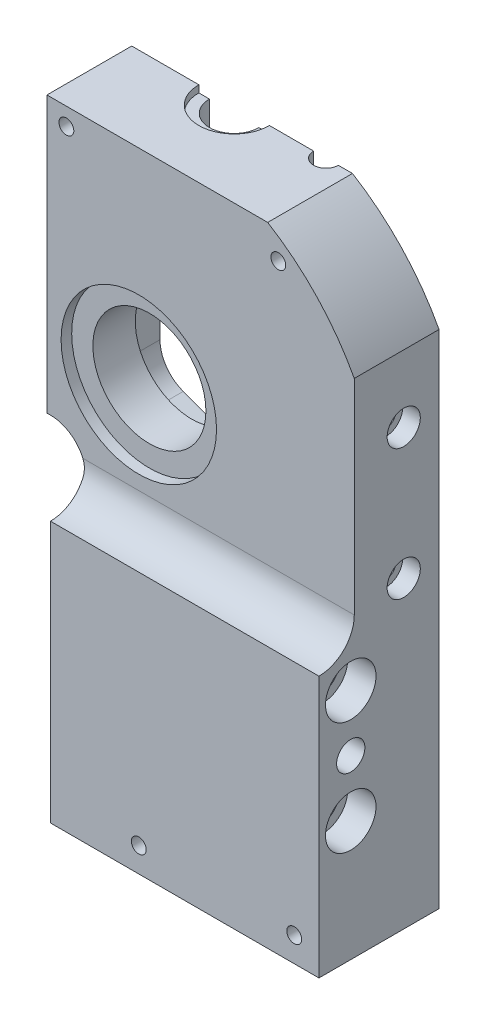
ISO-10303-21;
HEADER;
FILE_DESCRIPTION(('STEP AP214'),'2;1');
FILE_NAME('part.step','',(''),(''),'','','');
FILE_SCHEMA(('AUTOMOTIVE_DESIGN { 1 0 10303 214 1 1 1 1 }'));
ENDSEC;
DATA;
#1=APPLICATION_CONTEXT('core data for automotive mechanical design processes');
#2=APPLICATION_PROTOCOL_DEFINITION('international standard','automotive_design',2000,#1);
#3=PRODUCT_CONTEXT('',#1,'mechanical');
#4=PRODUCT('Part','Part','',(#3));
#5=PRODUCT_RELATED_PRODUCT_CATEGORY('part','',(#4));
#6=PRODUCT_DEFINITION_FORMATION('','',#4);
#7=PRODUCT_DEFINITION_CONTEXT('part definition',#1,'design');
#8=PRODUCT_DEFINITION('design','',#6,#7);
#9=PRODUCT_DEFINITION_SHAPE('','',#8);
#10=(LENGTH_UNIT() NAMED_UNIT(*) SI_UNIT(.MILLI.,.METRE.));
#11=(NAMED_UNIT(*) PLANE_ANGLE_UNIT() SI_UNIT($,.RADIAN.));
#12=(NAMED_UNIT(*) SI_UNIT($,.STERADIAN.) SOLID_ANGLE_UNIT());
#13=UNCERTAINTY_MEASURE_WITH_UNIT(LENGTH_MEASURE(1.E-05),#10,'distance_accuracy_value','');
#14=(GEOMETRIC_REPRESENTATION_CONTEXT(3) GLOBAL_UNCERTAINTY_ASSIGNED_CONTEXT((#13)) GLOBAL_UNIT_ASSIGNED_CONTEXT((#10,
#11,#12)) REPRESENTATION_CONTEXT('',''));
#15=CARTESIAN_POINT('',(0.,0.,0.));
#16=DIRECTION('',(0.,0.,1.));
#17=DIRECTION('',(1.,0.,0.));
#18=AXIS2_PLACEMENT_3D('',#15,#16,#17);
#19=CARTESIAN_POINT('',(20.,183.,20.));
#20=DIRECTION('',(-1.,0.,0.));
#21=DIRECTION('',(0.,-1.,0.));
#22=AXIS2_PLACEMENT_3D('',#19,#20,#21);
#23=PLANE('',#22);
#24=CARTESIAN_POINT('',(20.,160.,10.));
#25=DIRECTION('',(-1.,0.,0.));
#26=DIRECTION('',(0.,-1.,0.));
#27=AXIS2_PLACEMENT_3D('',#24,#25,#26);
#28=CIRCLE('',#27,2.75);
#29=CARTESIAN_POINT('',(20.,157.25,10.));
#30=VERTEX_POINT('',#29);
#31=EDGE_CURVE('E1240',#30,#30,#28,.F.);
#32=ORIENTED_EDGE('',*,*,#31,.T.);
#33=EDGE_LOOP('',(#32));
#34=FACE_BOUND('',#33,.T.);
#35=DIRECTION('',(0.,1.,0.));
#36=VECTOR('',#35,1.);
#37=CARTESIAN_POINT('',(20.,183.,0.));
#38=LINE('',#37,#36);
#39=CARTESIAN_POINT('',(20.,101.,0.));
#40=VERTEX_POINT('',#39);
#41=CARTESIAN_POINT('',(20.,183.,0.));
#42=VERTEX_POINT('',#41);
#43=EDGE_CURVE('E1120',#40,#42,#38,.T.);
#44=ORIENTED_EDGE('',*,*,#43,.F.);
#45=DIRECTION('',(0.,0.,-1.));
#46=VECTOR('',#45,1.);
#47=CARTESIAN_POINT('',(20.,101.,20.));
#48=LINE('',#47,#46);
#49=CARTESIAN_POINT('',(20.,101.,20.));
#50=VERTEX_POINT('',#49);
#51=EDGE_CURVE('E1098',#50,#40,#48,.T.);
#52=ORIENTED_EDGE('',*,*,#51,.F.);
#53=DIRECTION('',(0.,1.,0.));
#54=VECTOR('',#53,1.);
#55=CARTESIAN_POINT('',(20.,183.,20.));
#56=LINE('',#55,#54);
#57=CARTESIAN_POINT('',(20.,183.,20.));
#58=VERTEX_POINT('',#57);
#59=EDGE_CURVE('E1103',#50,#58,#56,.T.);
#60=ORIENTED_EDGE('',*,*,#59,.T.);
#61=DIRECTION('',(0.,0.,-1.));
#62=VECTOR('',#61,1.);
#63=CARTESIAN_POINT('',(20.,183.,20.));
#64=LINE('',#63,#62);
#65=EDGE_CURVE('E1101',#58,#42,#64,.T.);
#66=ORIENTED_EDGE('',*,*,#65,.T.);
#67=EDGE_LOOP('',(#44,#52,#60,#66));
#68=FACE_BOUND('',#67,.T.);
#69=CARTESIAN_POINT('',(20.,123.,10.));
#70=DIRECTION('',(-1.,0.,0.));
#71=DIRECTION('',(0.,-1.,0.));
#72=AXIS2_PLACEMENT_3D('',#69,#70,#71);
#73=CIRCLE('',#72,2.75);
#74=CARTESIAN_POINT('',(20.,120.25,10.));
#75=VERTEX_POINT('',#74);
#76=EDGE_CURVE('E1559',#75,#75,#73,.F.);
#77=ORIENTED_EDGE('',*,*,#76,.T.);
#78=EDGE_LOOP('',(#77));
#79=FACE_BOUND('',#78,.T.);
#80=ADVANCED_FACE('F351',(#34,#68,#79),#23,.T.);
#81=CARTESIAN_POINT('',(-31.,147.,34.));
#82=DIRECTION('',(0.,0.,1.));
#83=DIRECTION('',(1.,0.,0.));
#84=AXIS2_PLACEMENT_3D('',#81,#82,#83);
#85=PLANE('',#84);
#86=CARTESIAN_POINT('',(-22.,44.,34.));
#87=DIRECTION('',(0.,0.,-1.));
#88=DIRECTION('',(-1.,0.,0.));
#89=AXIS2_PLACEMENT_3D('',#86,#87,#88);
#90=CIRCLE('',#89,2.09999999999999);
#91=CARTESIAN_POINT('',(-24.1,44.,34.));
#92=VERTEX_POINT('',#91);
#93=EDGE_CURVE('E1247',#92,#92,#90,.T.);
#94=ORIENTED_EDGE('',*,*,#93,.T.);
#95=EDGE_LOOP('',(#94));
#96=FACE_BOUND('',#95,.T.);
#97=DIRECTION('',(0.,1.,0.));
#98=VECTOR('',#97,1.);
#99=CARTESIAN_POINT('',(29.,37.,34.));
#100=LINE('',#99,#98);
#101=CARTESIAN_POINT('',(29.,37.,34.));
#102=VERTEX_POINT('',#101);
#103=CARTESIAN_POINT('',(29.,111.,34.));
#104=VERTEX_POINT('',#103);
#105=EDGE_CURVE('E1035',#102,#104,#100,.T.);
#106=ORIENTED_EDGE('',*,*,#105,.T.);
#107=DIRECTION('',(-1.,0.,0.));
#108=VECTOR('',#107,1.);
#109=CARTESIAN_POINT('',(269.276533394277,111.,34.));
#110=LINE('',#109,#108);
#111=CARTESIAN_POINT('',(-47.,111.,34.));
#112=VERTEX_POINT('',#111);
#113=EDGE_CURVE('E887',#104,#112,#110,.T.);
#114=ORIENTED_EDGE('',*,*,#113,.T.);
#115=DIRECTION('',(0.,-1.,0.));
#116=VECTOR('',#115,1.);
#117=CARTESIAN_POINT('',(-47.,117.,34.));
#118=LINE('',#117,#116);
#119=CARTESIAN_POINT('',(-47.,37.,34.));
#120=VERTEX_POINT('',#119);
#121=EDGE_CURVE('E1040',#112,#120,#118,.T.);
#122=ORIENTED_EDGE('',*,*,#121,.T.);
#123=DIRECTION('',(1.,0.,0.));
#124=VECTOR('',#123,1.);
#125=CARTESIAN_POINT('',(-47.,37.,34.));
#126=LINE('',#125,#124);
#127=EDGE_CURVE('E1038',#120,#102,#126,.T.);
#128=ORIENTED_EDGE('',*,*,#127,.T.);
#129=EDGE_LOOP('',(#106,#114,#122,#128));
#130=FACE_BOUND('',#129,.T.);
#131=CARTESIAN_POINT('',(22.,44.,34.));
#132=DIRECTION('',(0.,0.,-1.));
#133=DIRECTION('',(-1.,0.,0.));
#134=AXIS2_PLACEMENT_3D('',#131,#132,#133);
#135=CIRCLE('',#134,2.09999999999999);
#136=CARTESIAN_POINT('',(19.9,44.,34.));
#137=VERTEX_POINT('',#136);
#138=EDGE_CURVE('E1222',#137,#137,#135,.T.);
#139=ORIENTED_EDGE('',*,*,#138,.T.);
#140=EDGE_LOOP('',(#139));
#141=FACE_BOUND('',#140,.T.);
#142=ADVANCED_FACE('F860',(#96,#130,#141),#85,.T.);
#143=CARTESIAN_POINT('',(-31.,147.,0.));
#144=DIRECTION('',(0.,0.,1.));
#145=DIRECTION('',(1.,0.,0.));
#146=AXIS2_PLACEMENT_3D('',#143,#144,#145);
#147=PLANE('',#146);
#148=DIRECTION('',(1.,0.,0.));
#149=VECTOR('',#148,1.);
#150=CARTESIAN_POINT('',(-31.,192.,0.));
#151=LINE('',#150,#149);
#152=CARTESIAN_POINT('',(-6.5,192.,0.));
#153=VERTEX_POINT('',#152);
#154=CARTESIAN_POINT('',(-5.5,192.,0.));
#155=VERTEX_POINT('',#154);
#156=EDGE_CURVE('E11',#153,#155,#151,.T.);
#157=ORIENTED_EDGE('',*,*,#156,.T.);
#158=DIRECTION('',(0.,-1.,0.));
#159=VECTOR('',#158,1.);
#160=CARTESIAN_POINT('',(-5.5,185.,0.));
#161=LINE('',#160,#159);
#162=CARTESIAN_POINT('',(-5.5,190.,0.));
#163=VERTEX_POINT('',#162);
#164=EDGE_CURVE('E677',#155,#163,#161,.T.);
#165=ORIENTED_EDGE('',*,*,#164,.T.);
#166=DIRECTION('',(1.,0.,0.));
#167=VECTOR('',#166,1.);
#168=CARTESIAN_POINT('',(8.,190.,0.));
#169=LINE('',#168,#167);
#170=CARTESIAN_POINT('',(-22.,190.,0.));
#171=VERTEX_POINT('',#170);
#172=EDGE_CURVE('E725',#171,#163,#169,.T.);
#173=ORIENTED_EDGE('',*,*,#172,.F.);
#174=DIRECTION('',(0.,-1.,0.));
#175=VECTOR('',#174,1.);
#176=CARTESIAN_POINT('',(-22.,185.,0.));
#177=LINE('',#176,#175);
#178=CARTESIAN_POINT('',(-22.,203.,0.));
#179=VERTEX_POINT('',#178);
#180=EDGE_CURVE('E377',#179,#171,#177,.T.);
#181=ORIENTED_EDGE('',*,*,#180,.F.);
#182=DIRECTION('',(-1.,0.,0.));
#183=VECTOR('',#182,1.);
#184=CARTESIAN_POINT('',(-31.,203.,0.));
#185=LINE('',#184,#183);
#186=CARTESIAN_POINT('',(-19.,203.,0.));
#187=VERTEX_POINT('',#186);
#188=EDGE_CURVE('E1202',#187,#179,#185,.T.);
#189=ORIENTED_EDGE('',*,*,#188,.F.);
#190=DIRECTION('',(0.,-1.,0.));
#191=VECTOR('',#190,1.);
#192=CARTESIAN_POINT('',(-19.,185.,0.));
#193=LINE('',#192,#191);
#194=CARTESIAN_POINT('',(-19.,205.,0.));
#195=VERTEX_POINT('',#194);
#196=EDGE_CURVE('E1198',#195,#187,#193,.T.);
#197=ORIENTED_EDGE('',*,*,#196,.F.);
#198=DIRECTION('',(-1.,0.,0.));
#199=VECTOR('',#198,1.);
#200=CARTESIAN_POINT('',(4.49647869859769,205.,0.));
#201=LINE('',#200,#199);
#202=CARTESIAN_POINT('',(-6.5,205.,0.));
#203=VERTEX_POINT('',#202);
#204=EDGE_CURVE('E1054',#203,#195,#201,.T.);
#205=ORIENTED_EDGE('',*,*,#204,.F.);
#206=DIRECTION('',(0.,-1.,0.));
#207=VECTOR('',#206,1.);
#208=CARTESIAN_POINT('',(-6.5,185.,0.));
#209=LINE('',#208,#207);
#210=EDGE_CURVE('E360',#203,#153,#209,.T.);
#211=ORIENTED_EDGE('',*,*,#210,.T.);
#212=EDGE_LOOP('',(#157,#165,#173,#181,#189,#197,#205,#211));
#213=FACE_BOUND('',#212,.T.);
#214=ADVANCED_FACE('F1273',(#213),#147,.F.);
#215=CARTESIAN_POINT('',(4.49647869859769,205.,34.));
#216=DIRECTION('',(0.,-1.,0.));
#217=DIRECTION('',(0.,0.,-1.));
#218=AXIS2_PLACEMENT_3D('',#215,#216,#217);
#219=PLANE('',#218);
#220=CARTESIAN_POINT('',(4.49647869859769,205.,0.));
#221=VERTEX_POINT('',#220);
#222=CARTESIAN_POINT('',(0.500000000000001,205.,0.));
#223=VERTEX_POINT('',#222);
#224=EDGE_CURVE('E1051',#221,#223,#201,.T.);
#225=ORIENTED_EDGE('',*,*,#224,.T.);
#226=CARTESIAN_POINT('',(-3.,205.,0.));
#227=DIRECTION('',(0.,-1.,0.));
#228=DIRECTION('',(1.,0.,0.));
#229=AXIS2_PLACEMENT_3D('',#226,#227,#228);
#230=CIRCLE('',#229,3.5);
#231=EDGE_CURVE('E1213',#223,#203,#230,.T.);
#232=ORIENTED_EDGE('',*,*,#231,.T.);
#233=ORIENTED_EDGE('',*,*,#204,.T.);
#234=CARTESIAN_POINT('',(-29.,205.,0.));
#235=DIRECTION('',(0.,-1.,0.));
#236=DIRECTION('',(0.,0.,-1.));
#237=AXIS2_PLACEMENT_3D('',#234,#235,#236);
#238=CIRCLE('',#237,9.99999999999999);
#239=CARTESIAN_POINT('',(-39.,205.,0.));
#240=VERTEX_POINT('',#239);
#241=EDGE_CURVE('E685',#195,#240,#238,.T.);
#242=ORIENTED_EDGE('',*,*,#241,.T.);
#243=CARTESIAN_POINT('',(-58.,205.,0.));
#244=VERTEX_POINT('',#243);
#245=EDGE_CURVE('E1055',#240,#244,#201,.T.);
#246=ORIENTED_EDGE('',*,*,#245,.T.);
#247=DIRECTION('',(0.,0.,-1.));
#248=VECTOR('',#247,1.);
#249=CARTESIAN_POINT('',(-58.,205.,34.));
#250=LINE('',#249,#248);
#251=CARTESIAN_POINT('',(-58.,205.,24.));
#252=VERTEX_POINT('',#251);
#253=EDGE_CURVE('E1026',#252,#244,#250,.T.);
#254=ORIENTED_EDGE('',*,*,#253,.F.);
#255=DIRECTION('',(-1.,0.,0.));
#256=VECTOR('',#255,1.);
#257=CARTESIAN_POINT('',(4.49647869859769,205.,24.));
#258=LINE('',#257,#256);
#259=CARTESIAN_POINT('',(4.49647869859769,205.,24.));
#260=VERTEX_POINT('',#259);
#261=EDGE_CURVE('E1135',#260,#252,#258,.T.);
#262=ORIENTED_EDGE('',*,*,#261,.F.);
#263=DIRECTION('',(0.,0.,-1.));
#264=VECTOR('',#263,1.);
#265=CARTESIAN_POINT('',(4.49647869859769,205.,34.));
#266=LINE('',#265,#264);
#267=EDGE_CURVE('E1024',#260,#221,#266,.T.);
#268=ORIENTED_EDGE('',*,*,#267,.T.);
#269=EDGE_LOOP('',(#225,#232,#233,#242,#246,#254,#262,#268));
#270=FACE_BOUND('',#269,.T.);
#271=ADVANCED_FACE('F1173',(#270),#219,.F.);
#272=CARTESIAN_POINT('',(-52.5,200.,0.));
#273=DIRECTION('',(0.,0.,-1.));
#274=DIRECTION('',(-1.,0.,0.));
#275=AXIS2_PLACEMENT_3D('',#272,#273,#274);
#276=CIRCLE('',#275,2.09999999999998);
#277=CARTESIAN_POINT('',(-54.6,200.,0.));
#278=VERTEX_POINT('',#277);
#279=EDGE_CURVE('E1226',#278,#278,#276,.T.);
#280=ORIENTED_EDGE('',*,*,#279,.F.);
#281=EDGE_LOOP('',(#280));
#282=FACE_BOUND('',#281,.T.);
#283=CARTESIAN_POINT('',(-22.,44.,0.));
#284=DIRECTION('',(0.,0.,-1.));
#285=DIRECTION('',(-1.,0.,0.));
#286=AXIS2_PLACEMENT_3D('',#283,#284,#285);
#287=CIRCLE('',#286,2.09999999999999);
#288=CARTESIAN_POINT('',(-24.1,44.,0.));
#289=VERTEX_POINT('',#288);
#290=EDGE_CURVE('E1250',#289,#289,#287,.T.);
#291=ORIENTED_EDGE('',*,*,#290,.F.);
#292=EDGE_LOOP('',(#291));
#293=FACE_BOUND('',#292,.T.);
#294=DIRECTION('',(0.,-1.,0.));
#295=VECTOR('',#294,1.);
#296=CARTESIAN_POINT('',(-36.,185.,0.));
#297=LINE('',#296,#295);
#298=CARTESIAN_POINT('',(-36.,190.,0.));
#299=VERTEX_POINT('',#298);
#300=CARTESIAN_POINT('',(-36.,203.,0.));
#301=VERTEX_POINT('',#300);
#302=EDGE_CURVE('E700',#299,#301,#297,.F.);
#303=ORIENTED_EDGE('',*,*,#302,.F.);
#304=CARTESIAN_POINT('',(-40.,190.,0.));
#305=VERTEX_POINT('',#304);
#306=EDGE_CURVE('E721',#305,#299,#169,.T.);
#307=ORIENTED_EDGE('',*,*,#306,.F.);
#308=CARTESIAN_POINT('',(-40.,180.,0.));
#309=DIRECTION('',(0.,0.,-1.));
#310=DIRECTION('',(1.,0.,0.));
#311=AXIS2_PLACEMENT_3D('',#308,#309,#310);
#312=CIRCLE('',#311,10.);
#313=CARTESIAN_POINT('',(-50.,180.,0.));
#314=VERTEX_POINT('',#313);
#315=EDGE_CURVE('E718',#314,#305,#312,.T.);
#316=ORIENTED_EDGE('',*,*,#315,.F.);
#317=DIRECTION('',(0.,1.,0.));
#318=VECTOR('',#317,1.);
#319=CARTESIAN_POINT('',(-50.,180.,0.));
#320=LINE('',#319,#318);
#321=CARTESIAN_POINT('',(-50.,137.,0.));
#322=VERTEX_POINT('',#321);
#323=EDGE_CURVE('E715',#322,#314,#320,.T.);
#324=ORIENTED_EDGE('',*,*,#323,.F.);
#325=CARTESIAN_POINT('',(-40.,137.,0.));
#326=DIRECTION('',(0.,0.,-1.));
#327=DIRECTION('',(1.,0.,0.));
#328=AXIS2_PLACEMENT_3D('',#325,#326,#327);
#329=CIRCLE('',#328,10.);
#330=CARTESIAN_POINT('',(-43.4202014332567,127.603073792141,0.));
#331=VERTEX_POINT('',#330);
#332=EDGE_CURVE('E712',#331,#322,#329,.T.);
#333=ORIENTED_EDGE('',*,*,#332,.F.);
#334=DIRECTION('',(-0.939692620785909,0.342020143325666,0.));
#335=VECTOR('',#334,1.);
#336=CARTESIAN_POINT('',(4.57979856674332,110.132502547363,0.));
#337=LINE('',#336,#335);
#338=CARTESIAN_POINT('',(-18.2259122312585,118.433102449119,0.));
#339=VERTEX_POINT('',#338);
#340=EDGE_CURVE('E727',#339,#331,#337,.T.);
#341=ORIENTED_EDGE('',*,*,#340,.F.);
#342=CARTESIAN_POINT('',(-11.,115.,0.));
#343=DIRECTION('',(0.,0.,-1.));
#344=DIRECTION('',(1.,0.,0.));
#345=AXIS2_PLACEMENT_3D('',#342,#343,#344);
#346=CIRCLE('',#345,8.00000000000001);
#347=CARTESIAN_POINT('',(-19.,115.,0.));
#348=VERTEX_POINT('',#347);
#349=EDGE_CURVE('E767',#348,#339,#346,.T.);
#350=ORIENTED_EDGE('',*,*,#349,.F.);
#351=DIRECTION('',(0.,1.,0.));
#352=VECTOR('',#351,1.);
#353=CARTESIAN_POINT('',(-19.,71.,0.));
#354=LINE('',#353,#352);
#355=CARTESIAN_POINT('',(-19.,71.,0.));
#356=VERTEX_POINT('',#355);
#357=EDGE_CURVE('E776',#356,#348,#354,.T.);
#358=ORIENTED_EDGE('',*,*,#357,.F.);
#359=CARTESIAN_POINT('',(-11.,71.,0.));
#360=DIRECTION('',(0.,0.,-1.));
#361=DIRECTION('',(-1.,0.,0.));
#362=AXIS2_PLACEMENT_3D('',#359,#360,#361);
#363=CIRCLE('',#362,8.00000000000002);
#364=CARTESIAN_POINT('',(-13.,63.2540333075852,0.));
#365=VERTEX_POINT('',#364);
#366=EDGE_CURVE('E774',#365,#356,#363,.T.);
#367=ORIENTED_EDGE('',*,*,#366,.F.);
#368=DIRECTION('',(0.,-1.,0.));
#369=VECTOR('',#368,1.);
#370=CARTESIAN_POINT('',(-13.,23.1096606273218,0.));
#371=LINE('',#370,#369);
#372=CARTESIAN_POINT('',(-13.,58.,0.));
#373=VERTEX_POINT('',#372);
#374=EDGE_CURVE('E983',#365,#373,#371,.T.);
#375=ORIENTED_EDGE('',*,*,#374,.T.);
#376=DIRECTION('',(-1.,0.,0.));
#377=VECTOR('',#376,1.);
#378=CARTESIAN_POINT('',(-31.,58.,0.));
#379=LINE('',#378,#377);
#380=CARTESIAN_POINT('',(-18.,58.,0.));
#381=VERTEX_POINT('',#380);
#382=EDGE_CURVE('E989',#373,#381,#379,.T.);
#383=ORIENTED_EDGE('',*,*,#382,.T.);
#384=DIRECTION('',(0.,-1.,0.));
#385=VECTOR('',#384,1.);
#386=CARTESIAN_POINT('',(-18.,23.1096606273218,0.));
#387=LINE('',#386,#385);
#388=CARTESIAN_POINT('',(-18.,53.,0.));
#389=VERTEX_POINT('',#388);
#390=EDGE_CURVE('E992',#381,#389,#387,.T.);
#391=ORIENTED_EDGE('',*,*,#390,.T.);
#392=DIRECTION('',(1.,0.,0.));
#393=VECTOR('',#392,1.);
#394=CARTESIAN_POINT('',(-31.,53.,0.));
#395=LINE('',#394,#393);
#396=CARTESIAN_POINT('',(-15.,53.,0.));
#397=VERTEX_POINT('',#396);
#398=EDGE_CURVE('E999',#389,#397,#395,.T.);
#399=ORIENTED_EDGE('',*,*,#398,.T.);
#400=DIRECTION('',(0.,-1.,0.));
#401=VECTOR('',#400,1.);
#402=CARTESIAN_POINT('',(-15.,23.1096606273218,0.));
#403=LINE('',#402,#401);
#404=CARTESIAN_POINT('',(-15.,37.,0.));
#405=VERTEX_POINT('',#404);
#406=EDGE_CURVE('E1000',#397,#405,#403,.T.);
#407=ORIENTED_EDGE('',*,*,#406,.T.);
#408=DIRECTION('',(1.,0.,0.));
#409=VECTOR('',#408,1.);
#410=CARTESIAN_POINT('',(-47.,37.,0.));
#411=LINE('',#410,#409);
#412=CARTESIAN_POINT('',(-47.,37.,0.));
#413=VERTEX_POINT('',#412);
#414=EDGE_CURVE('E1062',#413,#405,#411,.T.);
#415=ORIENTED_EDGE('',*,*,#414,.F.);
#416=DIRECTION('',(0.,-1.,0.));
#417=VECTOR('',#416,1.);
#418=CARTESIAN_POINT('',(-47.,117.,0.));
#419=LINE('',#418,#417);
#420=CARTESIAN_POINT('',(-47.,117.,0.));
#421=VERTEX_POINT('',#420);
#422=EDGE_CURVE('E1065',#421,#413,#419,.T.);
#423=ORIENTED_EDGE('',*,*,#422,.F.);
#424=CARTESIAN_POINT('',(-57.,117.,0.));
#425=DIRECTION('',(0.,0.,-1.));
#426=DIRECTION('',(1.,0.,0.));
#427=AXIS2_PLACEMENT_3D('',#424,#425,#426);
#428=CIRCLE('',#427,10.);
#429=CARTESIAN_POINT('',(-57.0000000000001,127.,0.));
#430=VERTEX_POINT('',#429);
#431=EDGE_CURVE('E1042',#430,#421,#428,.T.);
#432=ORIENTED_EDGE('',*,*,#431,.F.);
#433=DIRECTION('',(1.,0.,0.));
#434=VECTOR('',#433,1.);
#435=CARTESIAN_POINT('',(-58.,127.,0.));
#436=LINE('',#435,#434);
#437=CARTESIAN_POINT('',(-58.,127.,0.));
#438=VERTEX_POINT('',#437);
#439=EDGE_CURVE('E1045',#438,#430,#436,.T.);
#440=ORIENTED_EDGE('',*,*,#439,.F.);
#441=DIRECTION('',(0.,-1.,0.));
#442=VECTOR('',#441,1.);
#443=CARTESIAN_POINT('',(-58.,205.,0.));
#444=LINE('',#443,#442);
#445=EDGE_CURVE('E1048',#244,#438,#444,.T.);
#446=ORIENTED_EDGE('',*,*,#445,.F.);
#447=ORIENTED_EDGE('',*,*,#245,.F.);
#448=DIRECTION('',(0.,-1.,0.));
#449=VECTOR('',#448,1.);
#450=CARTESIAN_POINT('',(-39.,185.,0.));
#451=LINE('',#450,#449);
#452=CARTESIAN_POINT('',(-39.,203.,0.));
#453=VERTEX_POINT('',#452);
#454=EDGE_CURVE('E1204',#453,#240,#451,.F.);
#455=ORIENTED_EDGE('',*,*,#454,.F.);
#456=EDGE_CURVE('E1205',#301,#453,#185,.T.);
#457=ORIENTED_EDGE('',*,*,#456,.F.);
#458=EDGE_LOOP('',(#303,#307,#316,#324,#333,#341,#350,#358,#367,#375,#383,#391,#399,#407,#415,
#423,#432,#440,#446,#447,#455,#457));
#459=FACE_BOUND('',#458,.T.);
#460=ADVANCED_FACE('F900',(#282,#293,#459),#147,.F.);
#461=CARTESIAN_POINT('',(7.5,197.,0.));
#462=DIRECTION('',(0.,0.,-1.));
#463=DIRECTION('',(-1.,0.,0.));
#464=AXIS2_PLACEMENT_3D('',#461,#462,#463);
#465=CIRCLE('',#464,2.09999999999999);
#466=CARTESIAN_POINT('',(5.40000000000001,197.,0.));
#467=VERTEX_POINT('',#466);
#468=EDGE_CURVE('E1223',#467,#467,#465,.T.);
#469=ORIENTED_EDGE('',*,*,#468,.F.);
#470=EDGE_LOOP('',(#469));
#471=FACE_BOUND('',#470,.T.);
#472=CARTESIAN_POINT('',(22.,44.,0.));
#473=DIRECTION('',(0.,0.,-1.));
#474=DIRECTION('',(-1.,0.,0.));
#475=AXIS2_PLACEMENT_3D('',#472,#473,#474);
#476=CIRCLE('',#475,2.09999999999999);
#477=CARTESIAN_POINT('',(19.9,44.,0.));
#478=VERTEX_POINT('',#477);
#479=EDGE_CURVE('E1244',#478,#478,#476,.T.);
#480=ORIENTED_EDGE('',*,*,#479,.F.);
#481=EDGE_LOOP('',(#480));
#482=FACE_BOUND('',#481,.T.);
#483=CARTESIAN_POINT('',(-0.499999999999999,190.,0.));
#484=VERTEX_POINT('',#483);
#485=CARTESIAN_POINT('',(8.,190.,0.));
#486=VERTEX_POINT('',#485);
#487=EDGE_CURVE('E683',#484,#486,#169,.T.);
#488=ORIENTED_EDGE('',*,*,#487,.F.);
#489=DIRECTION('',(0.,-1.,0.));
#490=VECTOR('',#489,1.);
#491=CARTESIAN_POINT('',(-0.499999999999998,185.,0.));
#492=LINE('',#491,#490);
#493=CARTESIAN_POINT('',(-0.499999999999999,192.,0.));
#494=VERTEX_POINT('',#493);
#495=EDGE_CURVE('E369',#484,#494,#492,.F.);
#496=ORIENTED_EDGE('',*,*,#495,.T.);
#497=CARTESIAN_POINT('',(0.500000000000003,192.,0.));
#498=VERTEX_POINT('',#497);
#499=EDGE_CURVE('E362',#494,#498,#151,.T.);
#500=ORIENTED_EDGE('',*,*,#499,.T.);
#501=DIRECTION('',(0.,-1.,0.));
#502=VECTOR('',#501,1.);
#503=CARTESIAN_POINT('',(0.500000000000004,185.,0.));
#504=LINE('',#503,#502);
#505=EDGE_CURVE('E674',#498,#223,#504,.F.);
#506=ORIENTED_EDGE('',*,*,#505,.T.);
#507=ORIENTED_EDGE('',*,*,#224,.F.);
#508=CARTESIAN_POINT('',(-31.,147.,0.));
#509=DIRECTION('',(0.,0.,1.));
#510=DIRECTION('',(1.,0.,0.));
#511=AXIS2_PLACEMENT_3D('',#508,#509,#510);
#512=CIRCLE('',#511,68.);
#513=CARTESIAN_POINT('',(29.,179.,0.));
#514=VERTEX_POINT('',#513);
#515=EDGE_CURVE('E1056',#514,#221,#512,.T.);
#516=ORIENTED_EDGE('',*,*,#515,.F.);
#517=DIRECTION('',(0.,1.,0.));
#518=VECTOR('',#517,1.);
#519=CARTESIAN_POINT('',(29.,37.,0.));
#520=LINE('',#519,#518);
#521=CARTESIAN_POINT('',(29.,37.,0.));
#522=VERTEX_POINT('',#521);
#523=EDGE_CURVE('E1059',#522,#514,#520,.T.);
#524=ORIENTED_EDGE('',*,*,#523,.F.);
#525=CARTESIAN_POINT('',(15.,37.,0.));
#526=VERTEX_POINT('',#525);
#527=EDGE_CURVE('E1064',#526,#522,#411,.T.);
#528=ORIENTED_EDGE('',*,*,#527,.F.);
#529=DIRECTION('',(0.,-1.,0.));
#530=VECTOR('',#529,1.);
#531=CARTESIAN_POINT('',(15.,23.1096606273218,0.));
#532=LINE('',#531,#530);
#533=CARTESIAN_POINT('',(15.,53.,0.));
#534=VERTEX_POINT('',#533);
#535=EDGE_CURVE('E1010',#526,#534,#532,.F.);
#536=ORIENTED_EDGE('',*,*,#535,.T.);
#537=CARTESIAN_POINT('',(18.,53.,0.));
#538=VERTEX_POINT('',#537);
#539=EDGE_CURVE('E1005',#534,#538,#395,.T.);
#540=ORIENTED_EDGE('',*,*,#539,.T.);
#541=DIRECTION('',(0.,-1.,0.));
#542=VECTOR('',#541,1.);
#543=CARTESIAN_POINT('',(18.,23.1096606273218,0.));
#544=LINE('',#543,#542);
#545=CARTESIAN_POINT('',(18.,58.,0.));
#546=VERTEX_POINT('',#545);
#547=EDGE_CURVE('E1009',#538,#546,#544,.F.);
#548=ORIENTED_EDGE('',*,*,#547,.T.);
#549=CARTESIAN_POINT('',(13.,58.,0.));
#550=VERTEX_POINT('',#549);
#551=EDGE_CURVE('E994',#546,#550,#379,.T.);
#552=ORIENTED_EDGE('',*,*,#551,.T.);
#553=DIRECTION('',(0.,-1.,0.));
#554=VECTOR('',#553,1.);
#555=CARTESIAN_POINT('',(13.,23.1096606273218,0.));
#556=LINE('',#555,#554);
#557=CARTESIAN_POINT('',(13.,63.2540333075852,0.));
#558=VERTEX_POINT('',#557);
#559=EDGE_CURVE('E990',#550,#558,#556,.F.);
#560=ORIENTED_EDGE('',*,*,#559,.T.);
#561=CARTESIAN_POINT('',(11.,71.,0.));
#562=DIRECTION('',(0.,0.,-1.));
#563=DIRECTION('',(-1.,0.,0.));
#564=AXIS2_PLACEMENT_3D('',#561,#562,#563);
#565=CIRCLE('',#564,8.00000000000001);
#566=CARTESIAN_POINT('',(19.,71.,0.));
#567=VERTEX_POINT('',#566);
#568=EDGE_CURVE('E772',#567,#558,#565,.T.);
#569=ORIENTED_EDGE('',*,*,#568,.F.);
#570=DIRECTION('',(0.,-1.,0.));
#571=VECTOR('',#570,1.);
#572=CARTESIAN_POINT('',(19.,71.,0.));
#573=LINE('',#572,#571);
#574=CARTESIAN_POINT('',(19.,97.6833752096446,0.));
#575=VERTEX_POINT('',#574);
#576=EDGE_CURVE('E770',#575,#567,#573,.T.);
#577=ORIENTED_EDGE('',*,*,#576,.F.);
#578=CARTESIAN_POINT('',(14.,101.,0.));
#579=DIRECTION('',(0.,0.,1.));
#580=DIRECTION('',(-1.,0.,0.));
#581=AXIS2_PLACEMENT_3D('',#578,#579,#580);
#582=CIRCLE('',#581,6.);
#583=EDGE_CURVE('E1123',#575,#40,#582,.T.);
#584=ORIENTED_EDGE('',*,*,#583,.T.);
#585=ORIENTED_EDGE('',*,*,#43,.T.);
#586=CARTESIAN_POINT('',(14.,183.,0.));
#587=DIRECTION('',(0.,0.,1.));
#588=DIRECTION('',(-1.,0.,0.));
#589=AXIS2_PLACEMENT_3D('',#586,#587,#588);
#590=CIRCLE('',#589,6.);
#591=CARTESIAN_POINT('',(14.,189.,0.));
#592=VERTEX_POINT('',#591);
#593=EDGE_CURVE('E1128',#42,#592,#590,.T.);
#594=ORIENTED_EDGE('',*,*,#593,.T.);
#595=DIRECTION('',(-1.,0.,0.));
#596=VECTOR('',#595,1.);
#597=CARTESIAN_POINT('',(-4.,189.,0.));
#598=LINE('',#597,#596);
#599=CARTESIAN_POINT('',(12.3588989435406,189.,0.));
#600=VERTEX_POINT('',#599);
#601=EDGE_CURVE('E1125',#592,#600,#598,.T.);
#602=ORIENTED_EDGE('',*,*,#601,.T.);
#603=CARTESIAN_POINT('',(8.,180.,0.));
#604=DIRECTION('',(0.,0.,-1.));
#605=DIRECTION('',(1.,0.,0.));
#606=AXIS2_PLACEMENT_3D('',#603,#604,#605);
#607=CIRCLE('',#606,9.99999999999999);
#608=EDGE_CURVE('E724',#486,#600,#607,.T.);
#609=ORIENTED_EDGE('',*,*,#608,.F.);
#610=EDGE_LOOP('',(#488,#496,#500,#506,#507,#516,#524,#528,#536,#540,#548,#552,#560,#569,#577,
#584,#585,#594,#602,#609));
#611=FACE_BOUND('',#610,.T.);
#612=ADVANCED_FACE('F681',(#471,#482,#611),#147,.F.);
#613=CARTESIAN_POINT('',(8.,190.,9.));
#614=DIRECTION('',(0.,1.,0.));
#615=DIRECTION('',(-1.,0.,0.));
#616=AXIS2_PLACEMENT_3D('',#613,#614,#615);
#617=PLANE('',#616);
#618=ORIENTED_EDGE('',*,*,#172,.T.);
#619=CARTESIAN_POINT('',(-3.,190.,0.));
#620=DIRECTION('',(0.,-1.,0.));
#621=DIRECTION('',(1.,0.,0.));
#622=AXIS2_PLACEMENT_3D('',#619,#620,#621);
#623=CIRCLE('',#622,2.5);
#624=EDGE_CURVE('E678',#484,#163,#623,.T.);
#625=ORIENTED_EDGE('',*,*,#624,.F.);
#626=ORIENTED_EDGE('',*,*,#487,.T.);
#627=DIRECTION('',(0.,0.,-1.));
#628=VECTOR('',#627,1.);
#629=CARTESIAN_POINT('',(8.,190.,9.));
#630=LINE('',#629,#628);
#631=CARTESIAN_POINT('',(8.,190.,9.));
#632=VERTEX_POINT('',#631);
#633=EDGE_CURVE('E751',#632,#486,#630,.T.);
#634=ORIENTED_EDGE('',*,*,#633,.F.);
#635=DIRECTION('',(1.,0.,0.));
#636=VECTOR('',#635,1.);
#637=CARTESIAN_POINT('',(8.,190.,9.));
#638=LINE('',#637,#636);
#639=CARTESIAN_POINT('',(-40.,190.,9.));
#640=VERTEX_POINT('',#639);
#641=EDGE_CURVE('E738',#640,#632,#638,.T.);
#642=ORIENTED_EDGE('',*,*,#641,.F.);
#643=DIRECTION('',(0.,0.,-1.));
#644=VECTOR('',#643,1.);
#645=CARTESIAN_POINT('',(-40.,190.,9.));
#646=LINE('',#645,#644);
#647=EDGE_CURVE('E754',#640,#305,#646,.T.);
#648=ORIENTED_EDGE('',*,*,#647,.T.);
#649=ORIENTED_EDGE('',*,*,#306,.T.);
#650=CARTESIAN_POINT('',(-29.,190.,0.));
#651=DIRECTION('',(0.,-1.,0.));
#652=DIRECTION('',(0.,0.,-1.));
#653=AXIS2_PLACEMENT_3D('',#650,#651,#652);
#654=CIRCLE('',#653,7.00000000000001);
#655=EDGE_CURVE('E697',#171,#299,#654,.T.);
#656=ORIENTED_EDGE('',*,*,#655,.F.);
#657=EDGE_LOOP('',(#618,#625,#626,#634,#642,#648,#649,#656));
#658=FACE_BOUND('',#657,.T.);
#659=ADVANCED_FACE('F1288',(#658),#617,.F.);
#660=CARTESIAN_POINT('',(-47.,117.,34.));
#661=DIRECTION('',(1.,0.,0.));
#662=DIRECTION('',(0.,1.,0.));
#663=AXIS2_PLACEMENT_3D('',#660,#661,#662);
#664=PLANE('',#663);
#665=CARTESIAN_POINT('',(-47.,87.,25.));
#666=DIRECTION('',(1.,0.,0.));
#667=DIRECTION('',(0.,1.,0.));
#668=AXIS2_PLACEMENT_3D('',#665,#666,#667);
#669=CIRCLE('',#668,2.99999999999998);
#670=CARTESIAN_POINT('',(-47.,90.,25.));
#671=VERTEX_POINT('',#670);
#672=EDGE_CURVE('E1550',#671,#671,#669,.T.);
#673=ORIENTED_EDGE('',*,*,#672,.T.);
#674=EDGE_LOOP('',(#673));
#675=FACE_BOUND('',#674,.T.);
#676=CARTESIAN_POINT('',(-47.,71.,25.));
#677=DIRECTION('',(1.,0.,0.));
#678=DIRECTION('',(0.,1.,0.));
#679=AXIS2_PLACEMENT_3D('',#676,#677,#678);
#680=CIRCLE('',#679,4.49999999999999);
#681=CARTESIAN_POINT('',(-47.,75.5,25.));
#682=VERTEX_POINT('',#681);
#683=EDGE_CURVE('E1215',#682,#682,#680,.T.);
#684=ORIENTED_EDGE('',*,*,#683,.T.);
#685=EDGE_LOOP('',(#684));
#686=FACE_BOUND('',#685,.T.);
#687=CARTESIAN_POINT('',(-47.,103.,25.));
#688=DIRECTION('',(1.,0.,0.));
#689=DIRECTION('',(0.,1.,0.));
#690=AXIS2_PLACEMENT_3D('',#687,#688,#689);
#691=CIRCLE('',#690,4.49999999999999);
#692=CARTESIAN_POINT('',(-47.,107.5,25.));
#693=VERTEX_POINT('',#692);
#694=EDGE_CURVE('E1210',#693,#693,#691,.T.);
#695=ORIENTED_EDGE('',*,*,#694,.T.);
#696=EDGE_LOOP('',(#695));
#697=FACE_BOUND('',#696,.T.);
#698=CARTESIAN_POINT('',(-47.,121.,34.));
#699=DIRECTION('',(1.,0.,0.));
#700=DIRECTION('',(0.,1.,0.));
#701=AXIS2_PLACEMENT_3D('',#698,#699,#700);
#702=CIRCLE('',#701,10.);
#703=CARTESIAN_POINT('',(-47.,117.,24.8348486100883));
#704=VERTEX_POINT('',#703);
#705=EDGE_CURVE('E838',#704,#112,#702,.F.);
#706=ORIENTED_EDGE('',*,*,#705,.F.);
#707=DIRECTION('',(0.,0.,-1.));
#708=VECTOR('',#707,1.);
#709=CARTESIAN_POINT('',(-47.,117.,34.));
#710=LINE('',#709,#708);
#711=EDGE_CURVE('E1033',#704,#421,#710,.T.);
#712=ORIENTED_EDGE('',*,*,#711,.T.);
#713=ORIENTED_EDGE('',*,*,#422,.T.);
#714=DIRECTION('',(0.,0.,-1.));
#715=VECTOR('',#714,1.);
#716=CARTESIAN_POINT('',(-47.,37.,34.));
#717=LINE('',#716,#715);
#718=EDGE_CURVE('E1014',#120,#413,#717,.T.);
#719=ORIENTED_EDGE('',*,*,#718,.F.);
#720=ORIENTED_EDGE('',*,*,#121,.F.);
#721=EDGE_LOOP('',(#706,#712,#713,#719,#720));
#722=FACE_BOUND('',#721,.T.);
#723=ADVANCED_FACE('F353',(#675,#686,#697,#722),#664,.F.);
#724=CARTESIAN_POINT('',(29.,37.,34.));
#725=DIRECTION('',(-1.,0.,0.));
#726=DIRECTION('',(0.,-1.,0.));
#727=AXIS2_PLACEMENT_3D('',#724,#725,#726);
#728=PLANE('',#727);
#729=CARTESIAN_POINT('',(29.,87.,25.));
#730=DIRECTION('',(1.,0.,0.));
#731=DIRECTION('',(0.,0.,-1.));
#732=AXIS2_PLACEMENT_3D('',#729,#730,#731);
#733=CIRCLE('',#732,4.);
#734=CARTESIAN_POINT('',(29.,87.,21.));
#735=VERTEX_POINT('',#734);
#736=EDGE_CURVE('E1554',#735,#735,#733,.T.);
#737=ORIENTED_EDGE('',*,*,#736,.F.);
#738=EDGE_LOOP('',(#737));
#739=FACE_BOUND('',#738,.T.);
#740=CARTESIAN_POINT('',(29.,123.,10.));
#741=DIRECTION('',(1.,0.,0.));
#742=DIRECTION('',(0.,0.,-1.));
#743=AXIS2_PLACEMENT_3D('',#740,#741,#742);
#744=CIRCLE('',#743,4.69999999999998);
#745=CARTESIAN_POINT('',(29.,123.,5.30000000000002));
#746=VERTEX_POINT('',#745);
#747=EDGE_CURVE('E1560',#746,#746,#744,.T.);
#748=ORIENTED_EDGE('',*,*,#747,.F.);
#749=EDGE_LOOP('',(#748));
#750=FACE_BOUND('',#749,.T.);
#751=CARTESIAN_POINT('',(29.,160.,10.));
#752=DIRECTION('',(1.,0.,0.));
#753=DIRECTION('',(0.,0.,-1.));
#754=AXIS2_PLACEMENT_3D('',#751,#752,#753);
#755=CIRCLE('',#754,4.70000000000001);
#756=CARTESIAN_POINT('',(29.,160.,5.29999999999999));
#757=VERTEX_POINT('',#756);
#758=EDGE_CURVE('E1571',#757,#757,#755,.T.);
#759=ORIENTED_EDGE('',*,*,#758,.F.);
#760=EDGE_LOOP('',(#759));
#761=FACE_BOUND('',#760,.T.);
#762=CARTESIAN_POINT('',(29.,71.,25.));
#763=DIRECTION('',(1.,0.,0.));
#764=DIRECTION('',(0.,0.,-1.));
#765=AXIS2_PLACEMENT_3D('',#762,#763,#764);
#766=CIRCLE('',#765,7.15);
#767=CARTESIAN_POINT('',(29.,71.,17.85));
#768=VERTEX_POINT('',#767);
#769=EDGE_CURVE('E1219',#768,#768,#766,.T.);
#770=ORIENTED_EDGE('',*,*,#769,.F.);
#771=EDGE_LOOP('',(#770));
#772=FACE_BOUND('',#771,.T.);
#773=CARTESIAN_POINT('',(29.,103.,25.));
#774=DIRECTION('',(1.,0.,0.));
#775=DIRECTION('',(0.,0.,-1.));
#776=AXIS2_PLACEMENT_3D('',#773,#774,#775);
#777=CIRCLE('',#776,7.15);
#778=CARTESIAN_POINT('',(29.,103.,17.85));
#779=VERTEX_POINT('',#778);
#780=EDGE_CURVE('E1214',#779,#779,#777,.T.);
#781=ORIENTED_EDGE('',*,*,#780,.F.);
#782=EDGE_LOOP('',(#781));
#783=FACE_BOUND('',#782,.T.);
#784=CARTESIAN_POINT('',(29.,121.,34.));
#785=DIRECTION('',(-1.,0.,0.));
#786=DIRECTION('',(0.,-1.,0.));
#787=AXIS2_PLACEMENT_3D('',#784,#785,#786);
#788=CIRCLE('',#787,10.);
#789=CARTESIAN_POINT('',(29.,121.,24.));
#790=VERTEX_POINT('',#789);
#791=EDGE_CURVE('E1140',#104,#790,#788,.F.);
#792=ORIENTED_EDGE('',*,*,#791,.F.);
#793=ORIENTED_EDGE('',*,*,#105,.F.);
#794=DIRECTION('',(0.,0.,-1.));
#795=VECTOR('',#794,1.);
#796=CARTESIAN_POINT('',(29.,37.,34.));
#797=LINE('',#796,#795);
#798=EDGE_CURVE('E1017',#102,#522,#797,.T.);
#799=ORIENTED_EDGE('',*,*,#798,.T.);
#800=ORIENTED_EDGE('',*,*,#523,.T.);
#801=DIRECTION('',(0.,0.,-1.));
#802=VECTOR('',#801,1.);
#803=CARTESIAN_POINT('',(29.,179.,34.));
#804=LINE('',#803,#802);
#805=CARTESIAN_POINT('',(29.,179.,24.));
#806=VERTEX_POINT('',#805);
#807=EDGE_CURVE('E1022',#806,#514,#804,.T.);
#808=ORIENTED_EDGE('',*,*,#807,.F.);
#809=DIRECTION('',(0.,1.,0.));
#810=VECTOR('',#809,1.);
#811=CARTESIAN_POINT('',(29.,37.,24.));
#812=LINE('',#811,#810);
#813=EDGE_CURVE('E1131',#790,#806,#812,.T.);
#814=ORIENTED_EDGE('',*,*,#813,.F.);
#815=EDGE_LOOP('',(#792,#793,#799,#800,#808,#814));
#816=FACE_BOUND('',#815,.T.);
#817=ADVANCED_FACE('F1161',(#739,#750,#761,#772,#783,#816),#728,.F.);
#818=CARTESIAN_POINT('',(-31.,147.,34.));
#819=DIRECTION('',(0.,0.,-1.));
#820=DIRECTION('',(-1.,0.,0.));
#821=AXIS2_PLACEMENT_3D('',#818,#819,#820);
#822=CYLINDRICAL_SURFACE('',#821,68.);
#823=CARTESIAN_POINT('',(-31.,147.,24.));
#824=DIRECTION('',(0.,0.,1.));
#825=DIRECTION('',(1.,0.,0.));
#826=AXIS2_PLACEMENT_3D('',#823,#824,#825);
#827=CIRCLE('',#826,68.);
#828=EDGE_CURVE('E1133',#806,#260,#827,.T.);
#829=ORIENTED_EDGE('',*,*,#828,.F.);
#830=ORIENTED_EDGE('',*,*,#807,.T.);
#831=ORIENTED_EDGE('',*,*,#515,.T.);
#832=ORIENTED_EDGE('',*,*,#267,.F.);
#833=EDGE_LOOP('',(#829,#830,#831,#832));
#834=FACE_BOUND('',#833,.T.);
#835=ADVANCED_FACE('F1169',(#834),#822,.T.);
#836=CARTESIAN_POINT('',(-58.,205.,34.));
#837=DIRECTION('',(1.,0.,0.));
#838=DIRECTION('',(0.,1.,0.));
#839=AXIS2_PLACEMENT_3D('',#836,#837,#838);
#840=PLANE('',#839);
#841=DIRECTION('',(0.,-1.,0.));
#842=VECTOR('',#841,1.);
#843=CARTESIAN_POINT('',(-58.,205.,24.));
#844=LINE('',#843,#842);
#845=CARTESIAN_POINT('',(-58.,127.,24.));
#846=VERTEX_POINT('',#845);
#847=EDGE_CURVE('E1137',#252,#846,#844,.T.);
#848=ORIENTED_EDGE('',*,*,#847,.F.);
#849=ORIENTED_EDGE('',*,*,#253,.T.);
#850=ORIENTED_EDGE('',*,*,#445,.T.);
#851=DIRECTION('',(0.,0.,-1.));
#852=VECTOR('',#851,1.);
#853=CARTESIAN_POINT('',(-58.,127.,34.));
#854=LINE('',#853,#852);
#855=EDGE_CURVE('E1029',#846,#438,#854,.T.);
#856=ORIENTED_EDGE('',*,*,#855,.F.);
#857=EDGE_LOOP('',(#848,#849,#850,#856));
#858=FACE_BOUND('',#857,.T.);
#859=ADVANCED_FACE('F1180',(#858),#840,.F.);
#860=CARTESIAN_POINT('',(-58.,127.,34.));
#861=DIRECTION('',(0.,1.,0.));
#862=DIRECTION('',(0.,0.,1.));
#863=AXIS2_PLACEMENT_3D('',#860,#861,#862);
#864=PLANE('',#863);
#865=DIRECTION('',(1.,0.,0.));
#866=VECTOR('',#865,1.);
#867=CARTESIAN_POINT('',(-58.,127.,24.));
#868=LINE('',#867,#866);
#869=CARTESIAN_POINT('',(-57.0000000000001,127.,24.));
#870=VERTEX_POINT('',#869);
#871=EDGE_CURVE('E1139',#846,#870,#868,.T.);
#872=ORIENTED_EDGE('',*,*,#871,.F.);
#873=ORIENTED_EDGE('',*,*,#855,.T.);
#874=ORIENTED_EDGE('',*,*,#439,.T.);
#875=DIRECTION('',(0.,0.,-1.));
#876=VECTOR('',#875,1.);
#877=CARTESIAN_POINT('',(-57.0000000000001,127.,34.));
#878=LINE('',#877,#876);
#879=EDGE_CURVE('E1031',#870,#430,#878,.T.);
#880=ORIENTED_EDGE('',*,*,#879,.F.);
#881=EDGE_LOOP('',(#872,#873,#874,#880));
#882=FACE_BOUND('',#881,.T.);
#883=ADVANCED_FACE('F1184',(#882),#864,.F.);
#884=CARTESIAN_POINT('',(-57.,117.,34.));
#885=DIRECTION('',(0.,0.,-1.));
#886=DIRECTION('',(-1.,0.,0.));
#887=AXIS2_PLACEMENT_3D('',#884,#885,#886);
#888=CYLINDRICAL_SURFACE('',#887,10.);
#889=CARTESIAN_POINT('',(-67.,117.,43.1651513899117));
#890=CARTESIAN_POINT('',(-66.9999976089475,116.764192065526,43.0622330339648));
#891=CARTESIAN_POINT('',(-66.9916419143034,116.532319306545,42.9501812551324));
#892=CARTESIAN_POINT('',(-66.9600656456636,116.078664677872,42.7089913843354));
#893=CARTESIAN_POINT('',(-66.9368392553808,115.856886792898,42.5798466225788));
#894=CARTESIAN_POINT('',(-66.8775733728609,115.424832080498,42.3056042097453));
#895=CARTESIAN_POINT('',(-66.8415164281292,115.214571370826,42.1604850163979));
#896=CARTESIAN_POINT('',(-66.7587929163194,114.807002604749,41.8556727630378));
#897=CARTESIAN_POINT('',(-66.7121212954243,114.60970077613,41.695972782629));
#898=CARTESIAN_POINT('',(-66.6109125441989,114.230806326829,41.3648290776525));
#899=CARTESIAN_POINT('',(-66.5564544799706,114.049082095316,41.1935115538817));
#900=CARTESIAN_POINT('',(-66.4415681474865,113.699907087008,40.838904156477));
#901=CARTESIAN_POINT('',(-66.3811402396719,113.532455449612,40.6556150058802));
#902=CARTESIAN_POINT('',(-66.1940435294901,113.051893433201,40.0887533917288));
#903=CARTESIAN_POINT('',(-66.0615573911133,112.760560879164,39.6881735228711));
#904=CARTESIAN_POINT('',(-65.8559029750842,112.352358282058,39.0296458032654));
#905=CARTESIAN_POINT('',(-65.7817841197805,112.214419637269,38.784652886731));
#906=CARTESIAN_POINT('',(-65.6377833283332,111.959153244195,38.2827886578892));
#907=CARTESIAN_POINT('',(-65.5679020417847,111.841828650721,38.0259155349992));
#908=CARTESIAN_POINT('',(-65.4360505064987,111.628897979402,37.50176860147));
#909=CARTESIAN_POINT('',(-65.374069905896,111.533263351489,37.2345090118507));
#910=CARTESIAN_POINT('',(-65.2614935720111,111.36457344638,36.6906374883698));
#911=CARTESIAN_POINT('',(-65.2108940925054,111.291510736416,36.4140286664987));
#912=CARTESIAN_POINT('',(-65.1332736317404,111.18163264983,35.9109370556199));
#913=CARTESIAN_POINT('',(-65.1035448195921,111.140455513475,35.6858182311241));
#914=CARTESIAN_POINT('',(-65.0547476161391,111.073553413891,35.2321532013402));
#915=CARTESIAN_POINT('',(-65.0356777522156,111.047826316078,35.0036074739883));
#916=CARTESIAN_POINT('',(-65.0091698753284,111.012204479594,34.5448201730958));
#917=CARTESIAN_POINT('',(-65.0017210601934,111.002295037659,34.3145803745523));
#918=CARTESIAN_POINT('',(-64.9988110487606,110.998414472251,33.8538829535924));
#919=CARTESIAN_POINT('',(-65.0033501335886,111.004443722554,33.6234253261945));
#920=CARTESIAN_POINT('',(-65.0241672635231,111.032334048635,33.1642387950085));
#921=CARTESIAN_POINT('',(-65.0404339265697,111.054179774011,32.9355084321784));
#922=CARTESIAN_POINT('',(-65.0838658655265,111.113366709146,32.4811240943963));
#923=CARTESIAN_POINT('',(-65.1110313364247,111.150708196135,32.2554701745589));
#924=CARTESIAN_POINT('',(-65.1749954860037,111.240444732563,31.808400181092));
#925=CARTESIAN_POINT('',(-65.2118016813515,111.292851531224,31.586987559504));
#926=CARTESIAN_POINT('',(-65.2934566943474,111.412174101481,31.1495569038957));
#927=CARTESIAN_POINT('',(-65.3383086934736,111.479095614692,30.9335410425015));
#928=CARTESIAN_POINT('',(-65.4369783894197,111.631011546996,30.4959106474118));
#929=CARTESIAN_POINT('',(-65.4911563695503,111.716805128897,30.2746546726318));
#930=CARTESIAN_POINT('',(-65.6044035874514,111.903318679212,29.8399061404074));
#931=CARTESIAN_POINT('',(-65.6634728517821,112.004038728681,29.6264136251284));
#932=CARTESIAN_POINT('',(-65.8450374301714,112.328113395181,28.9979443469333));
#933=CARTESIAN_POINT('',(-65.9718501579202,112.573325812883,28.5951381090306));
#934=CARTESIAN_POINT('',(-66.1712402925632,113.009886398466,27.9801527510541));
#935=CARTESIAN_POINT('',(-66.2453373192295,113.183895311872,27.7558500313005));
#936=CARTESIAN_POINT('',(-66.3885823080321,113.551323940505,27.3218255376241));
#937=CARTESIAN_POINT('',(-66.4577292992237,113.744747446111,27.1121066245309));
#938=CARTESIAN_POINT('',(-66.5876456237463,114.150033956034,26.7089368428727));
#939=CARTESIAN_POINT('',(-66.6484237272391,114.361877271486,26.5154690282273));
#940=CARTESIAN_POINT('',(-66.7583679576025,114.803204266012,26.1461846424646));
#941=CARTESIAN_POINT('',(-66.8075383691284,115.032681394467,25.9703615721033));
#942=CARTESIAN_POINT('',(-66.880737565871,115.449466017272,25.6789772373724));
#943=CARTESIAN_POINT('',(-66.9079751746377,115.633290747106,25.5592203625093));
#944=CARTESIAN_POINT('',(-66.9526036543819,116.009293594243,25.3316025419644));
#945=CARTESIAN_POINT('',(-66.9699967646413,116.201469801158,25.2237388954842));
#946=CARTESIAN_POINT('',(-66.9936346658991,116.592951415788,25.0207740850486));
#947=CARTESIAN_POINT('',(-66.9998875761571,116.792251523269,24.9256636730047));
#948=CARTESIAN_POINT('',(-67.0001093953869,117.196742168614,24.7488410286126));
#949=CARTESIAN_POINT('',(-66.9940780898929,117.401932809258,24.6671290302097));
#950=CARTESIAN_POINT('',(-66.9687028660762,117.817648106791,24.5172944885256));
#951=CARTESIAN_POINT('',(-66.9492893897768,118.028195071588,24.4492453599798));
#952=CARTESIAN_POINT('',(-66.8963684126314,118.451697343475,24.3276328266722));
#953=CARTESIAN_POINT('',(-66.862860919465,118.664652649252,24.2740694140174));
#954=CARTESIAN_POINT('',(-66.7813625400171,119.090941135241,24.1814936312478));
#955=CARTESIAN_POINT('',(-66.7333724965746,119.304274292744,24.1424804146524));
#956=CARTESIAN_POINT('',(-66.6228474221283,119.729288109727,24.0787368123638));
#957=CARTESIAN_POINT('',(-66.560313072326,119.94096884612,24.0540057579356));
#958=CARTESIAN_POINT('',(-66.4265698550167,120.343821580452,24.0196714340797));
#959=CARTESIAN_POINT('',(-66.3564647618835,120.535272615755,24.0090105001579));
#960=CARTESIAN_POINT('',(-66.2045366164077,120.913836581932,23.9985779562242));
#961=CARTESIAN_POINT('',(-66.1227096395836,121.100948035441,23.9988100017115));
#962=CARTESIAN_POINT('',(-65.9479000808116,121.469528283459,24.0093277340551));
#963=CARTESIAN_POINT('',(-65.854919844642,121.650998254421,24.0196113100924));
#964=CARTESIAN_POINT('',(-65.6583661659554,122.007408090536,24.0492650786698));
#965=CARTESIAN_POINT('',(-65.5547886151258,122.182345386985,24.0686388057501));
#966=CARTESIAN_POINT('',(-65.3299225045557,122.537110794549,24.1171059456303));
#967=CARTESIAN_POINT('',(-65.2078964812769,122.71638978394,24.1467968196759));
#968=CARTESIAN_POINT('',(-64.9532254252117,123.065721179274,24.2140678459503));
#969=CARTESIAN_POINT('',(-64.8205767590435,123.2357703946,24.2516507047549));
#970=CARTESIAN_POINT('',(-64.4078808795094,123.731115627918,24.3741688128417));
#971=CARTESIAN_POINT('',(-64.1129832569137,124.041766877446,24.4688973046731));
#972=CARTESIAN_POINT('',(-63.4291597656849,124.676149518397,24.6930281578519));
#973=CARTESIAN_POINT('',(-63.0330393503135,124.991008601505,24.8255968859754));
#974=CARTESIAN_POINT('',(-62.4072820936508,125.415763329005,25.0263886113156));
#975=CARTESIAN_POINT('',(-62.1931555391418,125.549558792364,25.0937248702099));
#976=CARTESIAN_POINT('',(-61.7549098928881,125.80083008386,25.2266193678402));
#977=CARTESIAN_POINT('',(-61.5307899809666,125.918304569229,25.2921774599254));
#978=CARTESIAN_POINT('',(-61.0393217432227,126.152517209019,25.4283867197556));
#979=CARTESIAN_POINT('',(-60.7704922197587,126.26656174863,25.4983510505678));
#980=CARTESIAN_POINT('',(-60.2217542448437,126.471327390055,25.6286605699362));
#981=CARTESIAN_POINT('',(-59.9418446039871,126.562045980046,25.6890047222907));
#982=CARTESIAN_POINT('',(-59.3733834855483,126.71873074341,25.7960300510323));
#983=CARTESIAN_POINT('',(-59.084856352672,126.78476062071,25.8427463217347));
#984=CARTESIAN_POINT('',(-58.5009176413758,126.891169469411,25.9192532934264));
#985=CARTESIAN_POINT('',(-58.2055082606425,126.931556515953,25.9490493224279));
#986=CARTESIAN_POINT('',(-57.650374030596,126.98218889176,25.9866206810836));
#987=CARTESIAN_POINT('',(-57.391107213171,126.995718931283,25.9967906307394));
#988=CARTESIAN_POINT('',(-56.8721611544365,127.002548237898,26.0019098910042));
#989=CARTESIAN_POINT('',(-56.6124819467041,126.995849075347,25.9968603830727));
#990=CARTESIAN_POINT('',(-56.0950430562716,126.962344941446,25.9718703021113));
#991=CARTESIAN_POINT('',(-55.837284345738,126.93553040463,25.9519226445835));
#992=CARTESIAN_POINT('',(-55.3260292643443,126.862277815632,25.8984110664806));
#993=CARTESIAN_POINT('',(-55.0725329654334,126.815839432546,25.8648469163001));
#994=CARTESIAN_POINT('',(-54.6008516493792,126.710586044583,25.7906865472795));
#995=CARTESIAN_POINT('',(-54.3819965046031,126.653846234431,25.7513670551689));
#996=CARTESIAN_POINT('',(-53.9499386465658,126.526170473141,25.6652911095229));
#997=CARTESIAN_POINT('',(-53.7367380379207,126.455229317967,25.6185319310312));
#998=CARTESIAN_POINT('',(-53.1066509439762,126.221840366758,25.4696775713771));
#999=CARTESIAN_POINT('',(-52.6991690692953,126.038802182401,25.3589866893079));
#1000=CARTESIAN_POINT('',(-52.0735265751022,125.706310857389,25.1755606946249));
#1001=CARTESIAN_POINT('',(-51.8455164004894,125.573269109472,25.1056052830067));
#1002=CARTESIAN_POINT('',(-51.400687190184,125.289585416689,24.9653732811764));
#1003=CARTESIAN_POINT('',(-51.1838696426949,125.138941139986,24.8950966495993));
#1004=CARTESIAN_POINT('',(-50.762342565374,124.820576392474,24.7569857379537));
#1005=CARTESIAN_POINT('',(-50.5576331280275,124.652855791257,24.6891514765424));
#1006=CARTESIAN_POINT('',(-50.1612711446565,124.30082256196,24.5586124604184));
#1007=CARTESIAN_POINT('',(-49.9696164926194,124.116512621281,24.4959068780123));
#1008=CARTESIAN_POINT('',(-49.620756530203,123.753004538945,24.3847506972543));
#1009=CARTESIAN_POINT('',(-49.4620791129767,123.575466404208,24.3354908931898));
#1010=CARTESIAN_POINT('',(-49.1569622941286,123.20835590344,24.2450589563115));
#1011=CARTESIAN_POINT('',(-49.0105163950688,123.018790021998,24.2038825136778));
#1012=CARTESIAN_POINT('',(-48.7308495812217,122.628390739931,24.1314773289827));
#1013=CARTESIAN_POINT('',(-48.5976248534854,122.427560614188,24.1002457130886));
#1014=CARTESIAN_POINT('',(-48.3454469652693,122.015676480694,24.0495504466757));
#1015=CARTESIAN_POINT('',(-48.2264937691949,121.804622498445,24.0300867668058));
#1016=CARTESIAN_POINT('',(-48.0029503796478,121.371833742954,24.0045443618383));
#1017=CARTESIAN_POINT('',(-47.8984972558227,121.150020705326,23.9985861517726));
#1018=CARTESIAN_POINT('',(-47.7062088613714,120.699384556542,24.0019808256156));
#1019=CARTESIAN_POINT('',(-47.6183737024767,120.470561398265,24.0113338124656));
#1020=CARTESIAN_POINT('',(-47.4601282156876,120.008397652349,24.0465892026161));
#1021=CARTESIAN_POINT('',(-47.3897041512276,119.775060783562,24.0724785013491));
#1022=CARTESIAN_POINT('',(-47.266571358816,119.306309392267,24.1416275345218));
#1023=CARTESIAN_POINT('',(-47.2138599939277,119.070895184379,24.1848846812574));
#1024=CARTESIAN_POINT('',(-47.1323532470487,118.634483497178,24.2816207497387));
#1025=CARTESIAN_POINT('',(-47.1012115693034,118.433394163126,24.3327426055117));
#1026=CARTESIAN_POINT('',(-47.0514975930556,118.033394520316,24.4479032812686));
#1027=CARTESIAN_POINT('',(-47.0329238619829,117.83448396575,24.5119406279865));
#1028=CARTESIAN_POINT('',(-47.0077506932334,117.440399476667,24.6526457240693));
#1029=CARTESIAN_POINT('',(-47.0011525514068,117.245225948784,24.729314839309));
#1030=CARTESIAN_POINT('',(-46.9991244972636,116.86004451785,24.8947975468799));
#1031=CARTESIAN_POINT('',(-47.0036950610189,116.670036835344,24.9836116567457));
#1032=CARTESIAN_POINT('',(-47.02299053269,116.297145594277,25.172391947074));
#1033=CARTESIAN_POINT('',(-47.0376751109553,116.114236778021,25.2723125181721));
#1034=CARTESIAN_POINT('',(-47.0760813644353,115.755664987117,25.4829459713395));
#1035=CARTESIAN_POINT('',(-47.0998061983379,115.58000456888,25.5936626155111));
#1036=CARTESIAN_POINT('',(-47.1551366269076,115.236802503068,25.8251373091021));
#1037=CARTESIAN_POINT('',(-47.1867401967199,115.069258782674,25.9458927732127));
#1038=CARTESIAN_POINT('',(-47.2566461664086,114.742798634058,26.1968043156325));
#1039=CARTESIAN_POINT('',(-47.2949509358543,114.583885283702,26.3269637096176));
#1040=CARTESIAN_POINT('',(-47.4310755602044,114.072157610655,26.772999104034));
#1041=CARTESIAN_POINT('',(-47.540949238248,113.739002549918,27.1081279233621));
#1042=CARTESIAN_POINT('',(-47.7754880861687,113.124857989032,27.8191032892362));
#1043=CARTESIAN_POINT('',(-47.9001753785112,112.843948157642,28.1950106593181));
#1044=CARTESIAN_POINT('',(-48.0989626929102,112.439296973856,28.8238427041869));
#1045=CARTESIAN_POINT('',(-48.1732452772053,112.297774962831,29.0654454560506));
#1046=CARTESIAN_POINT('',(-48.3183058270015,112.035052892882,29.560599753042));
#1047=CARTESIAN_POINT('',(-48.3890831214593,111.913856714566,29.8141535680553));
#1048=CARTESIAN_POINT('',(-48.5235407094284,111.692800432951,30.3318704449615));
#1049=CARTESIAN_POINT('',(-48.5872289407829,111.592916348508,30.5960211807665));
#1050=CARTESIAN_POINT('',(-48.7040461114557,111.415336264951,31.1339284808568));
#1051=CARTESIAN_POINT('',(-48.7571784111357,111.337633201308,31.4076819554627));
#1052=CARTESIAN_POINT('',(-48.8403211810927,111.218668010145,31.9076830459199));
#1053=CARTESIAN_POINT('',(-48.8728293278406,111.173229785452,32.1325269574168));
#1054=CARTESIAN_POINT('',(-48.9274394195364,111.097801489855,32.5860414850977));
#1055=CARTESIAN_POINT('',(-48.9495427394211,111.067809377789,32.8147115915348));
#1056=CARTESIAN_POINT('',(-48.9822244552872,111.023710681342,33.2741561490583));
#1057=CARTESIAN_POINT('',(-48.9928153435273,111.009586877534,33.5049280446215));
#1058=CARTESIAN_POINT('',(-49.0019603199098,110.997382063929,33.9671428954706));
#1059=CARTESIAN_POINT('',(-49.000514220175,110.999301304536,34.1985858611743));
#1060=CARTESIAN_POINT('',(-48.985663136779,111.019151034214,34.6603396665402));
#1061=CARTESIAN_POINT('',(-48.9722607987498,111.037077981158,34.8906507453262));
#1062=CARTESIAN_POINT('',(-48.9341974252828,111.088667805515,35.3485498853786));
#1063=CARTESIAN_POINT('',(-48.9095361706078,111.122330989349,35.5761378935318));
#1064=CARTESIAN_POINT('',(-48.8501368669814,111.204975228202,36.027349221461));
#1065=CARTESIAN_POINT('',(-48.8153907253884,111.253968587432,36.2509692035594));
#1066=CARTESIAN_POINT('',(-48.7373727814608,111.366733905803,36.6929996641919));
#1067=CARTESIAN_POINT('',(-48.6940975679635,111.430511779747,36.9114080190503));
#1068=CARTESIAN_POINT('',(-48.5989159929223,111.575098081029,37.3506382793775));
#1069=CARTESIAN_POINT('',(-48.5467348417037,111.656482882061,37.5712107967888));
#1070=CARTESIAN_POINT('',(-48.4370993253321,111.833992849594,38.0049037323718));
#1071=CARTESIAN_POINT('',(-48.37964499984,111.930117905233,38.2180242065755));
#1072=CARTESIAN_POINT('',(-48.2022819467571,112.24009089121,38.8458029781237));
#1073=CARTESIAN_POINT('',(-48.0774049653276,112.475491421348,39.2487423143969));
#1074=CARTESIAN_POINT('',(-47.8791856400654,112.896158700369,39.8657440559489));
#1075=CARTESIAN_POINT('',(-47.8050060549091,113.064399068,40.0914480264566));
#1076=CARTESIAN_POINT('',(-47.660767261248,113.420120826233,40.5287689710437));
#1077=CARTESIAN_POINT('',(-47.5907088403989,113.607605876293,40.7403832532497));
#1078=CARTESIAN_POINT('',(-47.4580544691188,114.00094452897,41.1479636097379));
#1079=CARTESIAN_POINT('',(-47.3954520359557,114.206781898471,41.3439432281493));
#1080=CARTESIAN_POINT('',(-47.2808807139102,114.636098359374,41.7189316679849));
#1081=CARTESIAN_POINT('',(-47.2289082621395,114.859571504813,41.897946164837));
#1082=CARTESIAN_POINT('',(-47.1492182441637,115.269376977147,42.1980942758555));
#1083=CARTESIAN_POINT('',(-47.1186711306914,115.45237183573,42.323048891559));
#1084=CARTESIAN_POINT('',(-47.0672074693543,115.827225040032,42.5610547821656));
#1085=CARTESIAN_POINT('',(-47.0462887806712,116.019081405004,42.6741086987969));
#1086=CARTESIAN_POINT('',(-47.0154632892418,116.410482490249,42.8874046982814));
#1087=CARTESIAN_POINT('',(-47.0055485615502,116.610021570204,42.9876559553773));
#1088=CARTESIAN_POINT('',(-46.9979560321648,117.015583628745,43.1746542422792));
#1089=CARTESIAN_POINT('',(-47.0002784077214,117.221606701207,43.2614010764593));
#1090=CARTESIAN_POINT('',(-47.0182773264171,117.639721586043,43.421194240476));
#1091=CARTESIAN_POINT('',(-47.0340312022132,117.851841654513,43.4941582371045));
#1092=CARTESIAN_POINT('',(-47.0798156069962,118.279099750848,43.6253122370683));
#1093=CARTESIAN_POINT('',(-47.1098461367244,118.49423777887,43.6835022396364));
#1094=CARTESIAN_POINT('',(-47.1846762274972,118.925433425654,43.7849488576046));
#1095=CARTESIAN_POINT('',(-47.2294736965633,119.141490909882,43.8282075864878));
#1096=CARTESIAN_POINT('',(-47.3339897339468,119.572429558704,43.8999874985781));
#1097=CARTESIAN_POINT('',(-47.3937074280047,119.787310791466,43.9285095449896));
#1098=CARTESIAN_POINT('',(-47.5218191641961,120.194601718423,43.9694223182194));
#1099=CARTESIAN_POINT('',(-47.5889454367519,120.387290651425,43.9830356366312));
#1100=CARTESIAN_POINT('',(-47.735068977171,120.768655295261,43.9991457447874));
#1101=CARTESIAN_POINT('',(-47.8140702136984,120.957329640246,44.0016388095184));
#1102=CARTESIAN_POINT('',(-47.9834106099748,121.329303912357,43.9963071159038));
#1103=CARTESIAN_POINT('',(-48.0737473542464,121.512604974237,43.9884845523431));
#1104=CARTESIAN_POINT('',(-48.2652085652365,121.872890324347,43.9634678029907));
#1105=CARTESIAN_POINT('',(-48.3663371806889,122.049872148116,43.9462700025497));
#1106=CARTESIAN_POINT('',(-48.5851703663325,122.407137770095,43.9022365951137));
#1107=CARTESIAN_POINT('',(-48.7035087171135,122.586968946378,43.8748789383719));
#1108=CARTESIAN_POINT('',(-48.9508082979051,122.937728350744,43.8120839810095));
#1109=CARTESIAN_POINT('',(-49.0797733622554,123.108653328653,43.7766437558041));
#1110=CARTESIAN_POINT('',(-49.4814451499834,123.607058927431,43.6602031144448));
#1111=CARTESIAN_POINT('',(-49.7690411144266,123.920353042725,43.5690577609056));
#1112=CARTESIAN_POINT('',(-50.4354918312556,124.560375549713,43.3519242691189));
#1113=CARTESIAN_POINT('',(-50.8213478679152,124.878615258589,43.2226074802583));
#1114=CARTESIAN_POINT('',(-51.6357339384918,125.454205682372,42.9588142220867));
#1115=CARTESIAN_POINT('',(-52.0643401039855,125.711444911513,42.8243288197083));
#1116=CARTESIAN_POINT('',(-52.7702499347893,126.066051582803,42.6230842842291));
#1117=CARTESIAN_POINT('',(-53.0354779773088,126.185183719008,42.5516069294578));
#1118=CARTESIAN_POINT('',(-53.5773269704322,126.400546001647,42.417256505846));
#1119=CARTESIAN_POINT('',(-53.8539493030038,126.496773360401,42.3543844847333));
#1120=CARTESIAN_POINT('',(-54.4163020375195,126.664906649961,42.2413046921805));
#1121=CARTESIAN_POINT('',(-54.7020091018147,126.73687013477,42.1910670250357));
#1122=CARTESIAN_POINT('',(-55.2809413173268,126.855559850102,42.1066495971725));
#1123=CARTESIAN_POINT('',(-55.5741642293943,126.902293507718,42.0724651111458));
#1124=CARTESIAN_POINT('',(-56.1307762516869,126.965617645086,42.0257556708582));
#1125=CARTESIAN_POINT('',(-56.3936671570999,126.985082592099,42.0111734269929));
#1126=CARTESIAN_POINT('',(-56.920567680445,127.003157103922,41.9976400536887));
#1127=CARTESIAN_POINT('',(-57.1845772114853,127.001768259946,41.9986877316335));
#1128=CARTESIAN_POINT('',(-57.7111840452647,126.978161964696,42.0163449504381));
#1129=CARTESIAN_POINT('',(-57.9737810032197,126.955939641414,42.0329581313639));
#1130=CARTESIAN_POINT('',(-58.4950908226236,126.891092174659,42.0806335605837));
#1131=CARTESIAN_POINT('',(-58.7538036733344,126.848466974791,42.1116958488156));
#1132=CARTESIAN_POINT('',(-59.23123106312,126.750530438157,42.1813499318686));
#1133=CARTESIAN_POINT('',(-59.450683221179,126.697665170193,42.2183876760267));
#1134=CARTESIAN_POINT('',(-59.8841984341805,126.577682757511,42.3002844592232));
#1135=CARTESIAN_POINT('',(-60.0982598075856,126.510561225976,42.3451459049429));
#1136=CARTESIAN_POINT('',(-60.7311610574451,126.288613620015,42.4889160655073));
#1137=CARTESIAN_POINT('',(-61.1408058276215,126.113186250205,42.5970246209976));
#1138=CARTESIAN_POINT('',(-62.001383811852,125.675198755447,42.8439940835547));
#1139=CARTESIAN_POINT('',(-62.4466793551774,125.402685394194,42.9849030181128));
#1140=CARTESIAN_POINT('',(-63.0795818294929,124.943968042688,43.1909382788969));
#1141=CARTESIAN_POINT('',(-63.2847840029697,124.78266341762,43.2587546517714));
#1142=CARTESIAN_POINT('',(-63.6827886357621,124.443697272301,43.3900981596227));
#1143=CARTESIAN_POINT('',(-63.8755911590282,124.26603583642,43.4536253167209));
#1144=CARTESIAN_POINT('',(-64.231936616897,123.910640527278,43.5687020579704));
#1145=CARTESIAN_POINT('',(-64.3965749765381,123.734184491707,43.6208102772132));
#1146=CARTESIAN_POINT('',(-64.7135427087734,123.368652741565,43.7172623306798));
#1147=CARTESIAN_POINT('',(-64.8658775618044,123.179582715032,43.7616096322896));
#1148=CARTESIAN_POINT('',(-65.1572286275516,122.789547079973,43.8405843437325));
#1149=CARTESIAN_POINT('',(-65.2962473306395,122.588583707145,43.8752135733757));
#1150=CARTESIAN_POINT('',(-65.5598614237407,122.1757833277,43.9328220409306));
#1151=CARTESIAN_POINT('',(-65.6844570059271,121.963946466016,43.955801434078));
#1152=CARTESIAN_POINT('',(-65.9191940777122,121.528759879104,43.9884165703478));
#1153=CARTESIAN_POINT('',(-66.0291866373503,121.305319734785,43.9979231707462));
#1154=CARTESIAN_POINT('',(-66.2322291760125,120.850702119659,44.0014682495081));
#1155=CARTESIAN_POINT('',(-66.3252784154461,120.619524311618,43.9955060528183));
#1156=CARTESIAN_POINT('',(-66.4934675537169,120.152092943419,43.966735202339));
#1157=CARTESIAN_POINT('',(-66.5686309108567,119.915846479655,43.9439487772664));
#1158=CARTESIAN_POINT('',(-66.7007105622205,119.440689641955,43.8805839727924));
#1159=CARTESIAN_POINT('',(-66.7576325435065,119.201780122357,43.8400111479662));
#1160=CARTESIAN_POINT('',(-66.8387204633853,118.796766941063,43.7557491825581));
#1161=CARTESIAN_POINT('',(-66.8675840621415,118.630596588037,43.7167520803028));
#1162=CARTESIAN_POINT('',(-66.9166523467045,118.299248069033,43.6299149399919));
#1163=CARTESIAN_POINT('',(-66.9368555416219,118.134070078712,43.5820733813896));
#1164=CARTESIAN_POINT('',(-66.9688536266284,117.80570891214,43.4776674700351));
#1165=CARTESIAN_POINT('',(-66.9806501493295,117.642525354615,43.4211048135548));
#1166=CARTESIAN_POINT('',(-66.996224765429,117.318967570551,43.2994565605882));
#1167=CARTESIAN_POINT('',(-67.0000016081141,117.158593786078,43.2343696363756));
#1168=CARTESIAN_POINT('',(-67.,117.,43.1651513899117));
#1169=B_SPLINE_CURVE_WITH_KNOTS('',3,(#889,#890,#891,#892,#893,#894,#895,#896,#897,#898,#899,
#900,#901,#902,#903,#904,#905,#906,#907,#908,#909,#910,#911,#912,#913,#914,#915,#916,#917,#918,
#919,#920,#921,#922,#923,#924,#925,#926,#927,#928,#929,#930,#931,#932,#933,#934,#935,#936,#937,
#938,#939,#940,#941,#942,#943,#944,#945,#946,#947,#948,#949,#950,#951,#952,#953,#954,#955,#956,
#957,#958,#959,#960,#961,#962,#963,#964,#965,#966,#967,#968,#969,#970,#971,#972,#973,#974,#975,
#976,#977,#978,#979,#980,#981,#982,#983,#984,#985,#986,#987,#988,#989,#990,#991,#992,#993,#994,
#995,#996,#997,#998,#999,#1000,#1001,#1002,#1003,#1004,#1005,#1006,#1007,#1008,#1009,#1010,
#1011,#1012,#1013,#1014,#1015,#1016,#1017,#1018,#1019,#1020,#1021,#1022,#1023,#1024,#1025,#1026,
#1027,#1028,#1029,#1030,#1031,#1032,#1033,#1034,#1035,#1036,#1037,#1038,#1039,#1040,#1041,#1042,
#1043,#1044,#1045,#1046,#1047,#1048,#1049,#1050,#1051,#1052,#1053,#1054,#1055,#1056,#1057,#1058,
#1059,#1060,#1061,#1062,#1063,#1064,#1065,#1066,#1067,#1068,#1069,#1070,#1071,#1072,#1073,#1074,
#1075,#1076,#1077,#1078,#1079,#1080,#1081,#1082,#1083,#1084,#1085,#1086,#1087,#1088,#1089,#1090,
#1091,#1092,#1093,#1094,#1095,#1096,#1097,#1098,#1099,#1100,#1101,#1102,#1103,#1104,#1105,#1106,
#1107,#1108,#1109,#1110,#1111,#1112,#1113,#1114,#1115,#1116,#1117,#1118,#1119,#1120,#1121,#1122,
#1123,#1124,#1125,#1126,#1127,#1128,#1129,#1130,#1131,#1132,#1133,#1134,#1135,#1136,#1137,#1138,
#1139,#1140,#1141,#1142,#1143,#1144,#1145,#1146,#1147,#1148,#1149,#1150,#1151,#1152,#1153,#1154,
#1155,#1156,#1157,#1158,#1159,#1160,#1161,#1162,#1163,#1164,#1165,#1166,#1167,#1168),
.UNSPECIFIED.,.T.,.F.,(4,2,2,2,2,2,2,2,2,2,2,2,2,2,2,2,2,2,2,2,2,2,2,2,2,2,2,2,2,2,2,2,2,2,2,2,
2,2,2,2,2,2,2,2,2,2,2,2,2,2,2,2,2,2,2,2,2,2,2,2,2,2,2,2,2,2,2,2,2,2,2,2,2,2,2,2,2,2,2,2,2,2,2,2,
2,2,2,2,2,2,2,2,2,2,2,2,2,2,2,2,2,2,2,2,2,2,2,2,2,2,2,2,2,2,2,2,2,2,2,2,2,2,2,2,2,2,2,2,2,2,2,2,
2,2,2,2,2,2,2,4),(0.,0.77165452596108,1.54361104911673,2.31662164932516,3.09000106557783,
3.85602174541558,4.62199620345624,6.15388411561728,7.02539822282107,7.89704559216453,
8.76753888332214,9.63774522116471,10.3293488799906,11.0208569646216,11.711721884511,
12.4026030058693,13.0928145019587,13.783038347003,14.4738019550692,15.1648393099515,
15.8943755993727,16.6239158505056,18.0835209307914,18.962879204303,19.8424094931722,
20.7210109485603,21.5992875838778,22.261887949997,22.9243375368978,23.5863041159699,
24.248282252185,24.913727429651,25.5791722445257,26.2445783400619,26.9099532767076,
27.52175710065,28.1337662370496,28.7456468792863,29.3577656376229,30.0137872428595,
30.6700342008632,31.9819680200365,33.5449497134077,34.3283368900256,35.1117884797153,
36.0114438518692,36.9111960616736,37.8086103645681,38.7057419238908,39.4840045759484,
40.2622068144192,41.0407793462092,41.8193650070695,42.5071432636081,43.1951740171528,
44.5708951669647,45.3895632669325,46.2083399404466,47.0271228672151,47.8457733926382,
48.5745538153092,49.3029446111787,50.0311247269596,50.7593030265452,51.4939540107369,
52.2286099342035,52.9626843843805,53.6966495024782,54.3253075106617,54.9538938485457,
55.5825482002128,56.2112293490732,56.8374180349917,57.4638257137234,58.0900725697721,
58.7165413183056,60.1663747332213,61.6184011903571,62.4866090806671,63.354982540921,
64.2223736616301,65.0894882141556,65.7838149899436,66.4780499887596,67.1715309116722,
67.865022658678,68.5583609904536,69.2517128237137,69.9456225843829,70.6398104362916,
71.3616028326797,72.083389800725,73.5274013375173,74.399957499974,75.2726798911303,
76.1446378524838,77.0163030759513,77.6867159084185,78.3569796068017,79.0267602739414,
79.6965506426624,80.3702236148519,81.043896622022,81.7174742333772,82.3910123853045,
83.0038217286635,83.616836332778,84.2297205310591,84.8428411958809,85.4932107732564,
86.1438160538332,87.4443840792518,88.988725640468,90.535868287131,91.4330884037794,
92.3304176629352,93.2256032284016,94.1205251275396,94.9113248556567,95.7020642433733,
96.4929885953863,97.2839151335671,97.9694899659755,98.6552760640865,100.026578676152,
101.642075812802,102.45046929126,103.258858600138,103.998853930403,104.738517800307,
105.47804306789,106.217558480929,106.964115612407,107.710705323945,108.456310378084,
109.201682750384,109.720593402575,110.239593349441,110.75849247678,111.277472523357),.UNSPECIFIED.);
#1170=CARTESIAN_POINT('',(-47.8348486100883,121.,24.));
#1171=VERTEX_POINT('',#1170);
#1172=EDGE_CURVE('E832',#1171,#704,#1169,.T.);
#1173=ORIENTED_EDGE('',*,*,#1172,.F.);
#1174=CARTESIAN_POINT('',(-57.,117.,24.));
#1175=DIRECTION('',(0.,0.,1.));
#1176=DIRECTION('',(1.,0.,0.));
#1177=AXIS2_PLACEMENT_3D('',#1174,#1175,#1176);
#1178=CIRCLE('',#1177,10.);
#1179=EDGE_CURVE('E1153',#870,#1171,#1178,.F.);
#1180=ORIENTED_EDGE('',*,*,#1179,.F.);
#1181=ORIENTED_EDGE('',*,*,#879,.T.);
#1182=ORIENTED_EDGE('',*,*,#431,.T.);
#1183=ORIENTED_EDGE('',*,*,#711,.F.);
#1184=EDGE_LOOP('',(#1173,#1180,#1181,#1182,#1183));
#1185=FACE_BOUND('',#1184,.T.);
#1186=ADVANCED_FACE('F840',(#1185),#888,.F.);
#1187=CARTESIAN_POINT('',(0.,23.1096606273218,1.70530256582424E-10));
#1188=DIRECTION('',(0.,-1.,0.));
#1189=DIRECTION('',(0.,0.,-1.));
#1190=AXIS2_PLACEMENT_3D('',#1187,#1188,#1189);
#1191=CYLINDRICAL_SURFACE('',#1190,13.);
#1192=ORIENTED_EDGE('',*,*,#374,.F.);
#1193=CARTESIAN_POINT('',(-13.,63.2540333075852,0.));
#1194=CARTESIAN_POINT('',(-13.0000021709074,63.2540438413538,0.171406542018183));
#1195=CARTESIAN_POINT('',(-12.9966100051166,63.2531582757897,0.342810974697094));
#1196=CARTESIAN_POINT('',(-12.9830537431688,63.2496717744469,0.685328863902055));
#1197=CARTESIAN_POINT('',(-12.9728898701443,63.2470708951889,0.856442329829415));
#1198=CARTESIAN_POINT('',(-12.9458096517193,63.2402312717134,1.19806858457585));
#1199=CARTESIAN_POINT('',(-12.9288946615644,63.2359928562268,1.36858148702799));
#1200=CARTESIAN_POINT('',(-12.8883476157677,63.2260323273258,1.70875521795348));
#1201=CARTESIAN_POINT('',(-12.8647154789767,63.2203101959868,1.87841603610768));
#1202=CARTESIAN_POINT('',(-12.7849597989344,63.2014796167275,2.37845621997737));
#1203=CARTESIAN_POINT('',(-12.7193816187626,63.1865420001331,2.7073088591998));
#1204=CARTESIAN_POINT('',(-12.5630748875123,63.1537811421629,3.35877661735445));
#1205=CARTESIAN_POINT('',(-12.472348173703,63.1359581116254,3.68139219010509));
#1206=CARTESIAN_POINT('',(-12.2869934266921,63.1037599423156,4.25457210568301));
#1207=CARTESIAN_POINT('',(-12.1968144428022,63.0894117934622,4.506585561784));
#1208=CARTESIAN_POINT('',(-12.0010500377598,63.0622636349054,5.00463699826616));
#1209=CARTESIAN_POINT('',(-11.8954653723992,63.0494635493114,5.25067527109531));
#1210=CARTESIAN_POINT('',(-11.6672566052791,63.0270347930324,5.74014607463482));
#1211=CARTESIAN_POINT('',(-11.5443666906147,63.0174655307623,5.98345769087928));
#1212=CARTESIAN_POINT('',(-11.283427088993,63.0039626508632,6.46209698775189));
#1213=CARTESIAN_POINT('',(-11.1453710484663,63.0000314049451,6.6974212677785));
#1214=CARTESIAN_POINT('',(-11.,63.,6.92820323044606));
#1215=B_SPLINE_CURVE_WITH_KNOTS('',3,(#1193,#1194,#1195,#1196,#1197,#1198,#1199,#1200,#1201,
#1202,#1203,#1204,#1205,#1206,#1207,#1208,#1209,#1210,#1211,#1212,#1213,#1214),.UNSPECIFIED.,
.F.,.F.,(4,2,2,2,2,2,2,2,2,2,4),(0.,0.514179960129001,1.02834297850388,1.54240283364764,
2.05646889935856,3.06234157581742,4.06814078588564,4.87178845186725,5.67539670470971,
6.49306557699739,7.31107831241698),.UNSPECIFIED.);
#1216=CARTESIAN_POINT('',(-11.,63.,6.92820323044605));
#1217=VERTEX_POINT('',#1216);
#1218=EDGE_CURVE('E915',#365,#1217,#1215,.T.);
#1219=ORIENTED_EDGE('',*,*,#1218,.T.);
#1220=CARTESIAN_POINT('',(0.,63.,1.70530256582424E-10));
#1221=DIRECTION('',(0.,-1.,0.));
#1222=DIRECTION('',(0.,0.,-1.));
#1223=AXIS2_PLACEMENT_3D('',#1220,#1221,#1222);
#1224=CIRCLE('',#1223,13.);
#1225=CARTESIAN_POINT('',(-8.30662386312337,63.,10.));
#1226=VERTEX_POINT('',#1225);
#1227=EDGE_CURVE('E912',#1217,#1226,#1224,.F.);
#1228=ORIENTED_EDGE('',*,*,#1227,.T.);
#1229=DIRECTION('',(0.,-1.,0.));
#1230=VECTOR('',#1229,1.);
#1231=CARTESIAN_POINT('',(-8.30662386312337,23.1096606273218,10.));
#1232=LINE('',#1231,#1230);
#1233=CARTESIAN_POINT('',(-8.30662386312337,96.8223223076,10.));
#1234=VERTEX_POINT('',#1233);
#1235=EDGE_CURVE('E826',#1226,#1234,#1232,.F.);
#1236=ORIENTED_EDGE('',*,*,#1235,.T.);
#1237=CARTESIAN_POINT('',(-3.99999999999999,95.,12.3693168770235));
#1238=CARTESIAN_POINT('',(-4.17762051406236,94.9999805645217,12.3119155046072));
#1239=CARTESIAN_POINT('',(-4.35390961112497,95.0078850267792,12.2506451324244));
#1240=CARTESIAN_POINT('',(-4.70238538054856,95.0386953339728,12.1211320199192));
#1241=CARTESIAN_POINT('',(-4.87457591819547,95.0615864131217,12.0528961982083));
#1242=CARTESIAN_POINT('',(-5.21260808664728,95.1213215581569,11.910591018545));
#1243=CARTESIAN_POINT('',(-5.3784851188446,95.1580690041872,11.8365648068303));
#1244=CARTESIAN_POINT('',(-5.70419946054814,95.2446444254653,11.683088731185));
#1245=CARTESIAN_POINT('',(-5.86403533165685,95.2944754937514,11.6036375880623));
#1246=CARTESIAN_POINT('',(-6.33203314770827,95.4618559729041,11.3590763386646));
#1247=CARTESIAN_POINT('',(-6.63027884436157,95.5975879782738,11.1870782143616));
#1248=CARTESIAN_POINT('',(-7.1965226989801,95.9120171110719,10.8315402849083));
#1249=CARTESIAN_POINT('',(-7.46444323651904,96.0908209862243,10.6479726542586));
#1250=CARTESIAN_POINT('',(-7.85950831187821,96.4024201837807,10.3566492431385));
#1251=CARTESIAN_POINT('',(-7.99790835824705,96.5222525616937,10.2499971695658));
#1252=CARTESIAN_POINT('',(-8.26344898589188,96.7743012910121,10.0371479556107));
#1253=CARTESIAN_POINT('',(-8.39058711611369,96.9065203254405,9.93095091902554));
#1254=CARTESIAN_POINT('',(-8.63306733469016,97.1831282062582,9.7208985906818));
#1255=CARTESIAN_POINT('',(-8.7484088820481,97.327517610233,9.61704340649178));
#1256=CARTESIAN_POINT('',(-8.96655345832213,97.6283708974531,9.41398676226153));
#1257=CARTESIAN_POINT('',(-9.06936152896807,97.7848298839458,9.31478344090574));
#1258=CARTESIAN_POINT('',(-9.29763912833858,98.1711416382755,9.08781873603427));
#1259=CARTESIAN_POINT('',(-9.41719182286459,98.406549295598,8.96326276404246));
#1260=CARTESIAN_POINT('',(-9.5742934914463,98.7762504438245,8.79425163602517));
#1261=CARTESIAN_POINT('',(-9.6228708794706,98.9019451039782,8.74098593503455));
#1262=CARTESIAN_POINT('',(-9.71217078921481,99.1589140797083,8.64165378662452));
#1263=CARTESIAN_POINT('',(-9.75289343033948,99.2901883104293,8.5955872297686));
#1264=CARTESIAN_POINT('',(-9.82301873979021,99.5477923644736,8.51533553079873));
#1265=CARTESIAN_POINT('',(-9.85304105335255,99.6737554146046,8.48051868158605));
#1266=CARTESIAN_POINT('',(-9.90514259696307,99.9293471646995,8.41960495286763));
#1267=CARTESIAN_POINT('',(-9.92722552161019,100.058974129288,8.39350401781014));
#1268=CARTESIAN_POINT('',(-9.96317879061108,100.322913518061,8.35080301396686));
#1269=CARTESIAN_POINT('',(-9.97692460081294,100.457266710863,8.33434713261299));
#1270=CARTESIAN_POINT('',(-9.99536675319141,100.727723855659,8.31220138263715));
#1271=CARTESIAN_POINT('',(-10.0000456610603,100.863830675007,8.30653225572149));
#1272=CARTESIAN_POINT('',(-9.99999999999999,101.,8.30662386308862));
#1273=B_SPLINE_CURVE_WITH_KNOTS('',3,(#1237,#1238,#1239,#1240,#1241,#1242,#1243,#1244,#1245,
#1246,#1247,#1248,#1249,#1250,#1251,#1252,#1253,#1254,#1255,#1256,#1257,#1258,#1259,#1260,#1261,
#1262,#1263,#1264,#1265,#1266,#1267,#1268,#1269,#1270,#1271,#1272),.UNSPECIFIED.,.F.,.F.,(4,2,2,
2,2,2,2,2,2,2,2,2,2,2,2,2,2,4),(0.,0.559670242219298,1.11878988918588,1.67408082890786,
2.22950316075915,3.33513667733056,4.44353906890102,5.07857609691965,5.71375099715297,
6.34895501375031,6.98390266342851,7.85645925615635,8.29077012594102,8.72507439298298,
9.12682981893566,9.52839804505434,9.93582568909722,10.3440359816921),.UNSPECIFIED.);
#1274=CARTESIAN_POINT('',(-3.99999999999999,95.,12.3693168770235));
#1275=VERTEX_POINT('',#1274);
#1276=EDGE_CURVE('E879',#1275,#1234,#1273,.T.);
#1277=ORIENTED_EDGE('',*,*,#1276,.F.);
#1278=CARTESIAN_POINT('',(0.,95.,1.70530256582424E-10));
#1279=DIRECTION('',(0.,1.,0.));
#1280=DIRECTION('',(0.,0.,1.));
#1281=AXIS2_PLACEMENT_3D('',#1278,#1279,#1280);
#1282=CIRCLE('',#1281,13.);
#1283=CARTESIAN_POINT('',(8.30662386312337,95.,10.));
#1284=VERTEX_POINT('',#1283);
#1285=EDGE_CURVE('E888',#1284,#1275,#1282,.F.);
#1286=ORIENTED_EDGE('',*,*,#1285,.F.);
#1287=DIRECTION('',(0.,-1.,0.));
#1288=VECTOR('',#1287,1.);
#1289=CARTESIAN_POINT('',(8.30662386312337,23.1096606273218,10.));
#1290=LINE('',#1289,#1288);
#1291=CARTESIAN_POINT('',(8.30662386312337,63.,10.));
#1292=VERTEX_POINT('',#1291);
#1293=EDGE_CURVE('E819',#1284,#1292,#1290,.T.);
#1294=ORIENTED_EDGE('',*,*,#1293,.T.);
#1295=CARTESIAN_POINT('',(11.,63.,6.92820323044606));
#1296=VERTEX_POINT('',#1295);
#1297=EDGE_CURVE('E913',#1292,#1296,#1224,.F.);
#1298=ORIENTED_EDGE('',*,*,#1297,.T.);
#1299=CARTESIAN_POINT('',(11.,63.,6.92820323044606));
#1300=CARTESIAN_POINT('',(11.0913929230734,63.0000038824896,6.78309839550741));
#1301=CARTESIAN_POINT('',(11.1798982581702,63.0015655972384,6.63620854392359));
#1302=CARTESIAN_POINT('',(11.3510032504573,63.0072448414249,6.33909404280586));
#1303=CARTESIAN_POINT('',(11.4336034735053,63.0113621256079,6.18886971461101));
#1304=CARTESIAN_POINT('',(11.67230958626,63.0267039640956,5.73363262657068));
#1305=CARTESIAN_POINT('',(11.8193976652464,63.040919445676,5.42393386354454));
#1306=CARTESIAN_POINT('',(12.0856663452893,63.0728997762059,4.80093615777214));
#1307=CARTESIAN_POINT('',(12.2053814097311,63.0905812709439,4.48785969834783));
#1308=CARTESIAN_POINT('',(12.4202764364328,63.1263290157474,3.85342171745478));
#1309=CARTESIAN_POINT('',(12.5154586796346,63.1443952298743,3.532060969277));
#1310=CARTESIAN_POINT('',(12.6641147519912,63.1747051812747,2.94818686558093));
#1311=CARTESIAN_POINT('',(12.7221271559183,63.1873890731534,2.68684165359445));
#1312=CARTESIAN_POINT('',(12.8219236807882,63.2100565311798,2.16098949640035));
#1313=CARTESIAN_POINT('',(12.8637103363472,63.2200405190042,1.89648305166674));
#1314=CARTESIAN_POINT('',(12.9314706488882,63.2365814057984,1.36061065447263));
#1315=CARTESIAN_POINT('',(12.9571545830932,63.2430752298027,1.08920569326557));
#1316=CARTESIAN_POINT('',(12.9828539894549,63.2496221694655,0.681240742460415));
#1317=CARTESIAN_POINT('',(12.9892827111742,63.2512721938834,0.545081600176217));
#1318=CARTESIAN_POINT('',(12.9978557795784,63.2534792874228,0.272618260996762));
#1319=CARTESIAN_POINT('',(13.0000000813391,63.254036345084,0.136314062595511));
#1320=CARTESIAN_POINT('',(13.,63.2540333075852,0.));
#1321=B_SPLINE_CURVE_WITH_KNOTS('',3,(#1299,#1300,#1301,#1302,#1303,#1304,#1305,#1306,#1307,
#1308,#1309,#1310,#1311,#1312,#1313,#1314,#1315,#1316,#1317,#1318,#1319,#1320),.UNSPECIFIED.,
.F.,.F.,(4,2,2,2,2,2,2,2,2,2,4),(0.,0.514371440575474,1.028693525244,2.05690689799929,
3.06289715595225,4.06879384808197,4.87231707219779,5.67571472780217,6.49318105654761,
6.90208134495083,7.31098592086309),.UNSPECIFIED.);
#1322=EDGE_CURVE('E905',#1296,#558,#1321,.T.);
#1323=ORIENTED_EDGE('',*,*,#1322,.T.);
#1324=ORIENTED_EDGE('',*,*,#559,.F.);
#1325=CARTESIAN_POINT('',(0.,58.,1.70530256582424E-10));
#1326=DIRECTION('',(0.,-1.,0.));
#1327=DIRECTION('',(0.,0.,-1.));
#1328=AXIS2_PLACEMENT_3D('',#1325,#1326,#1327);
#1329=CIRCLE('',#1328,13.);
#1330=EDGE_CURVE('E988',#550,#373,#1329,.T.);
#1331=ORIENTED_EDGE('',*,*,#1330,.T.);
#1332=EDGE_LOOP('',(#1192,#1219,#1228,#1236,#1277,#1286,#1294,#1298,#1323,#1324,#1331));
#1333=FACE_BOUND('',#1332,.T.);
#1334=ADVANCED_FACE('F891',(#1333),#1191,.F.);
#1335=CARTESIAN_POINT('',(-47.,37.,34.));
#1336=DIRECTION('',(0.,1.,0.));
#1337=DIRECTION('',(0.,0.,1.));
#1338=AXIS2_PLACEMENT_3D('',#1335,#1336,#1337);
#1339=PLANE('',#1338);
#1340=ORIENTED_EDGE('',*,*,#414,.T.);
#1341=CARTESIAN_POINT('',(0.,37.,1.70530256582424E-10));
#1342=DIRECTION('',(0.,-1.,0.));
#1343=DIRECTION('',(0.,0.,-1.));
#1344=AXIS2_PLACEMENT_3D('',#1341,#1342,#1343);
#1345=CIRCLE('',#1344,15.);
#1346=EDGE_CURVE('E1078',#526,#405,#1345,.T.);
#1347=ORIENTED_EDGE('',*,*,#1346,.F.);
#1348=ORIENTED_EDGE('',*,*,#527,.T.);
#1349=ORIENTED_EDGE('',*,*,#798,.F.);
#1350=ORIENTED_EDGE('',*,*,#127,.F.);
#1351=ORIENTED_EDGE('',*,*,#718,.T.);
#1352=EDGE_LOOP('',(#1340,#1347,#1348,#1349,#1350,#1351));
#1353=FACE_BOUND('',#1352,.T.);
#1354=ADVANCED_FACE('F896',(#1353),#1339,.F.);
#1355=CARTESIAN_POINT('',(-13.,58.,1.70530256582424E-10));
#1356=DIRECTION('',(0.,1.,0.));
#1357=DIRECTION('',(0.,0.,1.));
#1358=AXIS2_PLACEMENT_3D('',#1355,#1356,#1357);
#1359=PLANE('',#1358);
#1360=CARTESIAN_POINT('',(0.,58.,1.70530256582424E-10));
#1361=DIRECTION('',(0.,-1.,0.));
#1362=DIRECTION('',(0.,0.,-1.));
#1363=AXIS2_PLACEMENT_3D('',#1360,#1361,#1362);
#1364=CIRCLE('',#1363,18.);
#1365=EDGE_CURVE('E1069',#546,#381,#1364,.T.);
#1366=ORIENTED_EDGE('',*,*,#1365,.T.);
#1367=ORIENTED_EDGE('',*,*,#382,.F.);
#1368=ORIENTED_EDGE('',*,*,#1330,.F.);
#1369=ORIENTED_EDGE('',*,*,#551,.F.);
#1370=EDGE_LOOP('',(#1366,#1367,#1368,#1369));
#1371=FACE_BOUND('',#1370,.T.);
#1372=ADVANCED_FACE('F898',(#1371),#1359,.F.);
#1373=CARTESIAN_POINT('',(0.,23.1096606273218,1.70530256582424E-10));
#1374=DIRECTION('',(0.,-1.,0.));
#1375=DIRECTION('',(0.,0.,-1.));
#1376=AXIS2_PLACEMENT_3D('',#1373,#1374,#1375);
#1377=CYLINDRICAL_SURFACE('',#1376,18.);
#1378=ORIENTED_EDGE('',*,*,#1365,.F.);
#1379=ORIENTED_EDGE('',*,*,#547,.F.);
#1380=CARTESIAN_POINT('',(0.,53.,1.70530256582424E-10));
#1381=DIRECTION('',(0.,-1.,0.));
#1382=DIRECTION('',(0.,0.,-1.));
#1383=AXIS2_PLACEMENT_3D('',#1380,#1381,#1382);
#1384=CIRCLE('',#1383,18.);
#1385=EDGE_CURVE('E1072',#538,#389,#1384,.T.);
#1386=ORIENTED_EDGE('',*,*,#1385,.T.);
#1387=ORIENTED_EDGE('',*,*,#390,.F.);
#1388=EDGE_LOOP('',(#1378,#1379,#1386,#1387));
#1389=FACE_BOUND('',#1388,.T.);
#1390=ADVANCED_FACE('F1341',(#1389),#1377,.F.);
#1391=CARTESIAN_POINT('',(-18.,53.,1.70530256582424E-10));
#1392=DIRECTION('',(0.,-1.,0.));
#1393=DIRECTION('',(0.,0.,-1.));
#1394=AXIS2_PLACEMENT_3D('',#1391,#1392,#1393);
#1395=PLANE('',#1394);
#1396=ORIENTED_EDGE('',*,*,#1385,.F.);
#1397=ORIENTED_EDGE('',*,*,#539,.F.);
#1398=CARTESIAN_POINT('',(0.,53.,1.70530256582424E-10));
#1399=DIRECTION('',(0.,-1.,0.));
#1400=DIRECTION('',(0.,0.,-1.));
#1401=AXIS2_PLACEMENT_3D('',#1398,#1399,#1400);
#1402=CIRCLE('',#1401,15.);
#1403=EDGE_CURVE('E1075',#534,#397,#1402,.T.);
#1404=ORIENTED_EDGE('',*,*,#1403,.T.);
#1405=ORIENTED_EDGE('',*,*,#398,.F.);
#1406=EDGE_LOOP('',(#1396,#1397,#1404,#1405));
#1407=FACE_BOUND('',#1406,.T.);
#1408=ADVANCED_FACE('F1344',(#1407),#1395,.F.);
#1409=CARTESIAN_POINT('',(0.,23.1096606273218,1.70530256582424E-10));
#1410=DIRECTION('',(0.,-1.,0.));
#1411=DIRECTION('',(0.,0.,-1.));
#1412=AXIS2_PLACEMENT_3D('',#1409,#1410,#1411);
#1413=CYLINDRICAL_SURFACE('',#1412,15.);
#1414=ORIENTED_EDGE('',*,*,#1403,.F.);
#1415=ORIENTED_EDGE('',*,*,#535,.F.);
#1416=ORIENTED_EDGE('',*,*,#1346,.T.);
#1417=ORIENTED_EDGE('',*,*,#406,.F.);
#1418=EDGE_LOOP('',(#1414,#1415,#1416,#1417));
#1419=FACE_BOUND('',#1418,.T.);
#1420=ADVANCED_FACE('F875',(#1419),#1413,.F.);
#1421=CARTESIAN_POINT('',(-3.99999999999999,101.,20.));
#1422=DIRECTION('',(0.,0.,-1.));
#1423=DIRECTION('',(-1.,0.,0.));
#1424=AXIS2_PLACEMENT_3D('',#1421,#1422,#1423);
#1425=CYLINDRICAL_SURFACE('',#1424,6.);
#1426=CARTESIAN_POINT('',(-3.99999999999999,101.,10.));
#1427=DIRECTION('',(0.,0.,1.));
#1428=DIRECTION('',(1.,0.,0.));
#1429=AXIS2_PLACEMENT_3D('',#1426,#1427,#1428);
#1430=CIRCLE('',#1429,6.);
#1431=CARTESIAN_POINT('',(-9.99999999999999,101.,10.));
#1432=VERTEX_POINT('',#1431);
#1433=EDGE_CURVE('E824',#1432,#1234,#1430,.T.);
#1434=ORIENTED_EDGE('',*,*,#1433,.F.);
#1435=DIRECTION('',(0.,0.,-1.));
#1436=VECTOR('',#1435,1.);
#1437=CARTESIAN_POINT('',(-9.99999999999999,101.,20.));
#1438=LINE('',#1437,#1436);
#1439=CARTESIAN_POINT('',(-9.99999999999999,101.,20.));
#1440=VERTEX_POINT('',#1439);
#1441=EDGE_CURVE('E1089',#1440,#1432,#1438,.T.);
#1442=ORIENTED_EDGE('',*,*,#1441,.F.);
#1443=CARTESIAN_POINT('',(-3.99999999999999,101.,20.));
#1444=DIRECTION('',(0.,0.,1.));
#1445=DIRECTION('',(-1.,0.,0.));
#1446=AXIS2_PLACEMENT_3D('',#1443,#1444,#1445);
#1447=CIRCLE('',#1446,6.);
#1448=CARTESIAN_POINT('',(-3.99999999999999,95.,20.));
#1449=VERTEX_POINT('',#1448);
#1450=EDGE_CURVE('E1109',#1440,#1449,#1447,.T.);
#1451=ORIENTED_EDGE('',*,*,#1450,.T.);
#1452=DIRECTION('',(0.,0.,-1.));
#1453=VECTOR('',#1452,1.);
#1454=CARTESIAN_POINT('',(-3.99999999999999,95.,20.));
#1455=LINE('',#1454,#1453);
#1456=EDGE_CURVE('E1092',#1449,#1275,#1455,.T.);
#1457=ORIENTED_EDGE('',*,*,#1456,.T.);
#1458=ORIENTED_EDGE('',*,*,#1276,.T.);
#1459=EDGE_LOOP('',(#1434,#1442,#1451,#1457,#1458));
#1460=FACE_BOUND('',#1459,.T.);
#1461=ADVANCED_FACE('F870',(#1460),#1425,.F.);
#1462=CARTESIAN_POINT('',(-3.99999999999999,95.,20.));
#1463=DIRECTION('',(0.,1.,0.));
#1464=DIRECTION('',(0.,0.,1.));
#1465=AXIS2_PLACEMENT_3D('',#1462,#1463,#1464);
#1466=PLANE('',#1465);
#1467=DIRECTION('',(1.,0.,0.));
#1468=VECTOR('',#1467,1.);
#1469=CARTESIAN_POINT('',(-3.99999999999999,95.,10.));
#1470=LINE('',#1469,#1468);
#1471=CARTESIAN_POINT('',(14.,95.,10.));
#1472=VERTEX_POINT('',#1471);
#1473=EDGE_CURVE('E803',#1284,#1472,#1470,.T.);
#1474=ORIENTED_EDGE('',*,*,#1473,.F.);
#1475=ORIENTED_EDGE('',*,*,#1285,.T.);
#1476=ORIENTED_EDGE('',*,*,#1456,.F.);
#1477=DIRECTION('',(1.,0.,0.));
#1478=VECTOR('',#1477,1.);
#1479=CARTESIAN_POINT('',(-3.99999999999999,95.,20.));
#1480=LINE('',#1479,#1478);
#1481=CARTESIAN_POINT('',(14.,95.,20.));
#1482=VERTEX_POINT('',#1481);
#1483=EDGE_CURVE('E1107',#1449,#1482,#1480,.T.);
#1484=ORIENTED_EDGE('',*,*,#1483,.T.);
#1485=DIRECTION('',(0.,0.,-1.));
#1486=VECTOR('',#1485,1.);
#1487=CARTESIAN_POINT('',(14.,95.,20.));
#1488=LINE('',#1487,#1486);
#1489=EDGE_CURVE('E1095',#1482,#1472,#1488,.T.);
#1490=ORIENTED_EDGE('',*,*,#1489,.T.);
#1491=EDGE_LOOP('',(#1474,#1475,#1476,#1484,#1490));
#1492=FACE_BOUND('',#1491,.T.);
#1493=ADVANCED_FACE('F866',(#1492),#1466,.T.);
#1494=CARTESIAN_POINT('',(14.,183.,20.));
#1495=DIRECTION('',(0.,0.,-1.));
#1496=DIRECTION('',(-1.,0.,0.));
#1497=AXIS2_PLACEMENT_3D('',#1494,#1495,#1496);
#1498=CYLINDRICAL_SURFACE('',#1497,6.);
#1499=ORIENTED_EDGE('',*,*,#593,.F.);
#1500=ORIENTED_EDGE('',*,*,#65,.F.);
#1501=CARTESIAN_POINT('',(14.,183.,20.));
#1502=DIRECTION('',(0.,0.,1.));
#1503=DIRECTION('',(-1.,0.,0.));
#1504=AXIS2_PLACEMENT_3D('',#1501,#1502,#1503);
#1505=CIRCLE('',#1504,6.);
#1506=CARTESIAN_POINT('',(14.,189.,20.));
#1507=VERTEX_POINT('',#1506);
#1508=EDGE_CURVE('E1117',#58,#1507,#1505,.T.);
#1509=ORIENTED_EDGE('',*,*,#1508,.T.);
#1510=DIRECTION('',(0.,0.,-1.));
#1511=VECTOR('',#1510,1.);
#1512=CARTESIAN_POINT('',(14.,189.,20.));
#1513=LINE('',#1512,#1511);
#1514=EDGE_CURVE('E1080',#1507,#592,#1513,.T.);
#1515=ORIENTED_EDGE('',*,*,#1514,.T.);
#1516=EDGE_LOOP('',(#1499,#1500,#1509,#1515));
#1517=FACE_BOUND('',#1516,.T.);
#1518=ADVANCED_FACE('F869',(#1517),#1498,.F.);
#1519=CARTESIAN_POINT('',(-4.,189.,20.));
#1520=DIRECTION('',(0.,-1.,0.));
#1521=DIRECTION('',(0.,0.,-1.));
#1522=AXIS2_PLACEMENT_3D('',#1519,#1520,#1521);
#1523=PLANE('',#1522);
#1524=DIRECTION('',(0.,0.,-1.));
#1525=VECTOR('',#1524,1.);
#1526=CARTESIAN_POINT('',(12.3588989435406,189.,9.));
#1527=LINE('',#1526,#1525);
#1528=CARTESIAN_POINT('',(12.3588989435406,189.,9.));
#1529=VERTEX_POINT('',#1528);
#1530=EDGE_CURVE('E1194',#600,#1529,#1527,.F.);
#1531=ORIENTED_EDGE('',*,*,#1530,.F.);
#1532=ORIENTED_EDGE('',*,*,#601,.F.);
#1533=ORIENTED_EDGE('',*,*,#1514,.F.);
#1534=DIRECTION('',(-1.,0.,0.));
#1535=VECTOR('',#1534,1.);
#1536=CARTESIAN_POINT('',(-4.,189.,20.));
#1537=LINE('',#1536,#1535);
#1538=CARTESIAN_POINT('',(-4.,189.,20.));
#1539=VERTEX_POINT('',#1538);
#1540=EDGE_CURVE('E1115',#1507,#1539,#1537,.T.);
#1541=ORIENTED_EDGE('',*,*,#1540,.T.);
#1542=DIRECTION('',(0.,0.,-1.));
#1543=VECTOR('',#1542,1.);
#1544=CARTESIAN_POINT('',(-4.,189.,20.));
#1545=LINE('',#1544,#1543);
#1546=CARTESIAN_POINT('',(-4.,189.,9.));
#1547=VERTEX_POINT('',#1546);
#1548=EDGE_CURVE('E1083',#1539,#1547,#1545,.T.);
#1549=ORIENTED_EDGE('',*,*,#1548,.T.);
#1550=DIRECTION('',(-1.,0.,0.));
#1551=VECTOR('',#1550,1.);
#1552=CARTESIAN_POINT('',(-4.,189.,9.));
#1553=LINE('',#1552,#1551);
#1554=EDGE_CURVE('E765',#1529,#1547,#1553,.T.);
#1555=ORIENTED_EDGE('',*,*,#1554,.F.);
#1556=EDGE_LOOP('',(#1531,#1532,#1533,#1541,#1549,#1555));
#1557=FACE_BOUND('',#1556,.T.);
#1558=ADVANCED_FACE('F1297',(#1557),#1523,.T.);
#1559=CARTESIAN_POINT('',(-4.,183.,20.));
#1560=DIRECTION('',(0.,0.,-1.));
#1561=DIRECTION('',(-1.,0.,0.));
#1562=AXIS2_PLACEMENT_3D('',#1559,#1560,#1561);
#1563=CYLINDRICAL_SURFACE('',#1562,6.);
#1564=CARTESIAN_POINT('',(-4.,183.,9.));
#1565=DIRECTION('',(0.,0.,1.));
#1566=DIRECTION('',(1.,0.,0.));
#1567=AXIS2_PLACEMENT_3D('',#1564,#1565,#1566);
#1568=CIRCLE('',#1567,6.);
#1569=CARTESIAN_POINT('',(-10.,183.,9.));
#1570=VERTEX_POINT('',#1569);
#1571=EDGE_CURVE('E763',#1547,#1570,#1568,.T.);
#1572=ORIENTED_EDGE('',*,*,#1571,.F.);
#1573=ORIENTED_EDGE('',*,*,#1548,.F.);
#1574=CARTESIAN_POINT('',(-4.,183.,20.));
#1575=DIRECTION('',(0.,0.,1.));
#1576=DIRECTION('',(-1.,0.,0.));
#1577=AXIS2_PLACEMENT_3D('',#1574,#1575,#1576);
#1578=CIRCLE('',#1577,6.);
#1579=CARTESIAN_POINT('',(-10.,183.,20.));
#1580=VERTEX_POINT('',#1579);
#1581=EDGE_CURVE('E1113',#1539,#1580,#1578,.T.);
#1582=ORIENTED_EDGE('',*,*,#1581,.T.);
#1583=DIRECTION('',(0.,0.,-1.));
#1584=VECTOR('',#1583,1.);
#1585=CARTESIAN_POINT('',(-10.,183.,20.));
#1586=LINE('',#1585,#1584);
#1587=EDGE_CURVE('E1086',#1580,#1570,#1586,.T.);
#1588=ORIENTED_EDGE('',*,*,#1587,.T.);
#1589=EDGE_LOOP('',(#1572,#1573,#1582,#1588));
#1590=FACE_BOUND('',#1589,.T.);
#1591=ADVANCED_FACE('F1309',(#1590),#1563,.F.);
#1592=CARTESIAN_POINT('',(-10.,183.,20.));
#1593=DIRECTION('',(1.,0.,0.));
#1594=DIRECTION('',(0.,1.,0.));
#1595=AXIS2_PLACEMENT_3D('',#1592,#1593,#1594);
#1596=PLANE('',#1595);
#1597=DIRECTION('',(0.,-1.,0.));
#1598=VECTOR('',#1597,1.);
#1599=CARTESIAN_POINT('',(-10.,183.,9.));
#1600=LINE('',#1599,#1598);
#1601=CARTESIAN_POINT('',(-9.99999999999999,123.,9.));
#1602=VERTEX_POINT('',#1601);
#1603=EDGE_CURVE('E761',#1570,#1602,#1600,.T.);
#1604=ORIENTED_EDGE('',*,*,#1603,.F.);
#1605=ORIENTED_EDGE('',*,*,#1587,.F.);
#1606=DIRECTION('',(0.,-1.,0.));
#1607=VECTOR('',#1606,1.);
#1608=CARTESIAN_POINT('',(-10.,183.,20.));
#1609=LINE('',#1608,#1607);
#1610=EDGE_CURVE('E1111',#1580,#1440,#1609,.T.);
#1611=ORIENTED_EDGE('',*,*,#1610,.T.);
#1612=ORIENTED_EDGE('',*,*,#1441,.T.);
#1613=DIRECTION('',(0.,-1.,0.));
#1614=VECTOR('',#1613,1.);
#1615=CARTESIAN_POINT('',(-10.,183.,10.));
#1616=LINE('',#1615,#1614);
#1617=CARTESIAN_POINT('',(-9.99999999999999,123.,10.));
#1618=VERTEX_POINT('',#1617);
#1619=EDGE_CURVE('E822',#1618,#1432,#1616,.T.);
#1620=ORIENTED_EDGE('',*,*,#1619,.F.);
#1621=DIRECTION('',(0.,0.,1.));
#1622=VECTOR('',#1621,1.);
#1623=CARTESIAN_POINT('',(-9.99999999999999,123.,20.));
#1624=LINE('',#1623,#1622);
#1625=EDGE_CURVE('E974',#1602,#1618,#1624,.T.);
#1626=ORIENTED_EDGE('',*,*,#1625,.F.);
#1627=EDGE_LOOP('',(#1604,#1605,#1611,#1612,#1620,#1626));
#1628=FACE_BOUND('',#1627,.T.);
#1629=ADVANCED_FACE('F864',(#1628),#1596,.T.);
#1630=CARTESIAN_POINT('',(14.,101.,20.));
#1631=DIRECTION('',(0.,0.,-1.));
#1632=DIRECTION('',(-1.,0.,0.));
#1633=AXIS2_PLACEMENT_3D('',#1630,#1631,#1632);
#1634=CYLINDRICAL_SURFACE('',#1633,6.);
#1635=DIRECTION('',(0.,0.,-1.));
#1636=VECTOR('',#1635,1.);
#1637=CARTESIAN_POINT('',(19.,97.6833752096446,20.));
#1638=LINE('',#1637,#1636);
#1639=CARTESIAN_POINT('',(19.,97.6833752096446,10.));
#1640=VERTEX_POINT('',#1639);
#1641=EDGE_CURVE('E1190',#1640,#575,#1638,.T.);
#1642=ORIENTED_EDGE('',*,*,#1641,.F.);
#1643=CARTESIAN_POINT('',(14.,101.,10.));
#1644=DIRECTION('',(0.,0.,1.));
#1645=DIRECTION('',(1.,0.,0.));
#1646=AXIS2_PLACEMENT_3D('',#1643,#1644,#1645);
#1647=CIRCLE('',#1646,6.);
#1648=EDGE_CURVE('E1189',#1472,#1640,#1647,.T.);
#1649=ORIENTED_EDGE('',*,*,#1648,.F.);
#1650=ORIENTED_EDGE('',*,*,#1489,.F.);
#1651=CARTESIAN_POINT('',(14.,101.,20.));
#1652=DIRECTION('',(0.,0.,1.));
#1653=DIRECTION('',(-1.,0.,0.));
#1654=AXIS2_PLACEMENT_3D('',#1651,#1652,#1653);
#1655=CIRCLE('',#1654,6.);
#1656=EDGE_CURVE('E1105',#1482,#50,#1655,.T.);
#1657=ORIENTED_EDGE('',*,*,#1656,.T.);
#1658=ORIENTED_EDGE('',*,*,#51,.T.);
#1659=ORIENTED_EDGE('',*,*,#583,.F.);
#1660=EDGE_LOOP('',(#1642,#1649,#1650,#1657,#1658,#1659));
#1661=FACE_BOUND('',#1660,.T.);
#1662=ADVANCED_FACE('F856',(#1661),#1634,.F.);
#1663=CARTESIAN_POINT('',(14.,183.,20.));
#1664=DIRECTION('',(0.,0.,-1.));
#1665=DIRECTION('',(-1.,0.,0.));
#1666=AXIS2_PLACEMENT_3D('',#1663,#1664,#1665);
#1667=PLANE('',#1666);
#1668=ORIENTED_EDGE('',*,*,#1508,.F.);
#1669=ORIENTED_EDGE('',*,*,#59,.F.);
#1670=ORIENTED_EDGE('',*,*,#1656,.F.);
#1671=ORIENTED_EDGE('',*,*,#1483,.F.);
#1672=ORIENTED_EDGE('',*,*,#1450,.F.);
#1673=ORIENTED_EDGE('',*,*,#1610,.F.);
#1674=ORIENTED_EDGE('',*,*,#1581,.F.);
#1675=ORIENTED_EDGE('',*,*,#1540,.F.);
#1676=EDGE_LOOP('',(#1668,#1669,#1670,#1671,#1672,#1673,#1674,#1675));
#1677=FACE_BOUND('',#1676,.T.);
#1678=ADVANCED_FACE('F853',(#1677),#1667,.T.);
#1679=CARTESIAN_POINT('',(269.276533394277,121.,24.));
#1680=DIRECTION('',(0.,0.,1.));
#1681=DIRECTION('',(1.,0.,0.));
#1682=AXIS2_PLACEMENT_3D('',#1679,#1680,#1681);
#1683=PLANE('',#1682);
#1684=CARTESIAN_POINT('',(-52.5,200.,24.));
#1685=DIRECTION('',(0.,0.,1.));
#1686=DIRECTION('',(1.,0.,0.));
#1687=AXIS2_PLACEMENT_3D('',#1684,#1685,#1686);
#1688=CIRCLE('',#1687,2.09999999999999);
#1689=CARTESIAN_POINT('',(-50.4,200.,24.));
#1690=VERTEX_POINT('',#1689);
#1691=EDGE_CURVE('E1224',#1690,#1690,#1688,.T.);
#1692=ORIENTED_EDGE('',*,*,#1691,.F.);
#1693=EDGE_LOOP('',(#1692));
#1694=FACE_BOUND('',#1693,.T.);
#1695=CARTESIAN_POINT('',(7.5,197.,24.));
#1696=DIRECTION('',(0.,0.,1.));
#1697=DIRECTION('',(1.,0.,0.));
#1698=AXIS2_PLACEMENT_3D('',#1695,#1696,#1697);
#1699=CIRCLE('',#1698,2.09999999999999);
#1700=CARTESIAN_POINT('',(9.59999999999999,197.,24.));
#1701=VERTEX_POINT('',#1700);
#1702=EDGE_CURVE('E1220',#1701,#1701,#1699,.T.);
#1703=ORIENTED_EDGE('',*,*,#1702,.F.);
#1704=EDGE_LOOP('',(#1703));
#1705=FACE_BOUND('',#1704,.T.);
#1706=CARTESIAN_POINT('',(-32.,147.,24.));
#1707=DIRECTION('',(0.,0.,1.));
#1708=DIRECTION('',(1.,0.,0.));
#1709=AXIS2_PLACEMENT_3D('',#1706,#1707,#1708);
#1710=CIRCLE('',#1709,22.);
#1711=CARTESIAN_POINT('',(-10.,147.,24.));
#1712=VERTEX_POINT('',#1711);
#1713=EDGE_CURVE('E708',#1712,#1712,#1710,.T.);
#1714=ORIENTED_EDGE('',*,*,#1713,.F.);
#1715=EDGE_LOOP('',(#1714));
#1716=FACE_BOUND('',#1715,.T.);
#1717=DIRECTION('',(-1.,0.,0.));
#1718=VECTOR('',#1717,1.);
#1719=CARTESIAN_POINT('',(269.276533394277,121.,24.));
#1720=LINE('',#1719,#1718);
#1721=EDGE_CURVE('E829',#790,#1171,#1720,.T.);
#1722=ORIENTED_EDGE('',*,*,#1721,.F.);
#1723=ORIENTED_EDGE('',*,*,#813,.T.);
#1724=ORIENTED_EDGE('',*,*,#828,.T.);
#1725=ORIENTED_EDGE('',*,*,#261,.T.);
#1726=ORIENTED_EDGE('',*,*,#847,.T.);
#1727=ORIENTED_EDGE('',*,*,#871,.T.);
#1728=ORIENTED_EDGE('',*,*,#1179,.T.);
#1729=EDGE_LOOP('',(#1722,#1723,#1724,#1725,#1726,#1727,#1728));
#1730=FACE_BOUND('',#1729,.T.);
#1731=ADVANCED_FACE('F850',(#1694,#1705,#1716,#1730),#1683,.T.);
#1732=CARTESIAN_POINT('',(269.276533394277,121.,34.));
#1733=DIRECTION('',(-1.,0.,0.));
#1734=DIRECTION('',(0.,-1.,0.));
#1735=AXIS2_PLACEMENT_3D('',#1732,#1733,#1734);
#1736=CYLINDRICAL_SURFACE('',#1735,10.);
#1737=ORIENTED_EDGE('',*,*,#113,.F.);
#1738=ORIENTED_EDGE('',*,*,#791,.T.);
#1739=ORIENTED_EDGE('',*,*,#1721,.T.);
#1740=ORIENTED_EDGE('',*,*,#1172,.T.);
#1741=ORIENTED_EDGE('',*,*,#705,.T.);
#1742=EDGE_LOOP('',(#1737,#1738,#1739,#1740,#1741));
#1743=FACE_BOUND('',#1742,.T.);
#1744=ADVANCED_FACE('F844',(#1743),#1736,.F.);
#1745=CARTESIAN_POINT('',(-11.,115.,10.));
#1746=DIRECTION('',(0.,0.,1.));
#1747=DIRECTION('',(1.,0.,0.));
#1748=AXIS2_PLACEMENT_3D('',#1745,#1746,#1747);
#1749=PLANE('',#1748);
#1750=ORIENTED_EDGE('',*,*,#1473,.T.);
#1751=ORIENTED_EDGE('',*,*,#1648,.T.);
#1752=DIRECTION('',(0.,-1.,0.));
#1753=VECTOR('',#1752,1.);
#1754=CARTESIAN_POINT('',(19.,71.,10.));
#1755=LINE('',#1754,#1753);
#1756=CARTESIAN_POINT('',(19.,71.,10.));
#1757=VERTEX_POINT('',#1756);
#1758=EDGE_CURVE('E785',#1640,#1757,#1755,.T.);
#1759=ORIENTED_EDGE('',*,*,#1758,.T.);
#1760=CARTESIAN_POINT('',(11.,71.,10.));
#1761=DIRECTION('',(0.,0.,-1.));
#1762=DIRECTION('',(-1.,0.,0.));
#1763=AXIS2_PLACEMENT_3D('',#1760,#1761,#1762);
#1764=CIRCLE('',#1763,8.00000000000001);
#1765=CARTESIAN_POINT('',(11.,63.,10.));
#1766=VERTEX_POINT('',#1765);
#1767=EDGE_CURVE('E787',#1757,#1766,#1764,.T.);
#1768=ORIENTED_EDGE('',*,*,#1767,.T.);
#1769=DIRECTION('',(-1.,0.,0.));
#1770=VECTOR('',#1769,1.);
#1771=CARTESIAN_POINT('',(11.,63.,10.));
#1772=LINE('',#1771,#1770);
#1773=EDGE_CURVE('E791',#1766,#1292,#1772,.T.);
#1774=ORIENTED_EDGE('',*,*,#1773,.T.);
#1775=ORIENTED_EDGE('',*,*,#1293,.F.);
#1776=EDGE_LOOP('',(#1750,#1751,#1759,#1768,#1774,#1775));
#1777=FACE_BOUND('',#1776,.T.);
#1778=ADVANCED_FACE('F849',(#1777),#1749,.F.);
#1779=CARTESIAN_POINT('',(19.,71.,10.));
#1780=DIRECTION('',(1.,0.,0.));
#1781=DIRECTION('',(0.,0.,-1.));
#1782=AXIS2_PLACEMENT_3D('',#1779,#1780,#1781);
#1783=PLANE('',#1782);
#1784=ORIENTED_EDGE('',*,*,#1641,.T.);
#1785=ORIENTED_EDGE('',*,*,#576,.T.);
#1786=DIRECTION('',(0.,0.,-1.));
#1787=VECTOR('',#1786,1.);
#1788=CARTESIAN_POINT('',(19.,71.,10.));
#1789=LINE('',#1788,#1787);
#1790=EDGE_CURVE('E813',#1757,#567,#1789,.T.);
#1791=ORIENTED_EDGE('',*,*,#1790,.F.);
#1792=ORIENTED_EDGE('',*,*,#1758,.F.);
#1793=EDGE_LOOP('',(#1784,#1785,#1791,#1792));
#1794=FACE_BOUND('',#1793,.T.);
#1795=ADVANCED_FACE('F927',(#1794),#1783,.F.);
#1796=CARTESIAN_POINT('',(11.,71.,10.));
#1797=DIRECTION('',(0.,0.,-1.));
#1798=DIRECTION('',(-1.,0.,0.));
#1799=AXIS2_PLACEMENT_3D('',#1796,#1797,#1798);
#1800=CYLINDRICAL_SURFACE('',#1799,8.00000000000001);
#1801=DIRECTION('',(0.,0.,-1.));
#1802=VECTOR('',#1801,1.);
#1803=CARTESIAN_POINT('',(11.,63.,10.));
#1804=LINE('',#1803,#1802);
#1805=EDGE_CURVE('E810',#1766,#1296,#1804,.T.);
#1806=ORIENTED_EDGE('',*,*,#1805,.F.);
#1807=ORIENTED_EDGE('',*,*,#1767,.F.);
#1808=ORIENTED_EDGE('',*,*,#1790,.T.);
#1809=ORIENTED_EDGE('',*,*,#568,.T.);
#1810=ORIENTED_EDGE('',*,*,#1322,.F.);
#1811=EDGE_LOOP('',(#1806,#1807,#1808,#1809,#1810));
#1812=FACE_BOUND('',#1811,.T.);
#1813=ADVANCED_FACE('F921',(#1812),#1800,.F.);
#1814=CARTESIAN_POINT('',(11.,63.,10.));
#1815=DIRECTION('',(0.,-1.,0.));
#1816=DIRECTION('',(0.,0.,-1.));
#1817=AXIS2_PLACEMENT_3D('',#1814,#1815,#1816);
#1818=PLANE('',#1817);
#1819=ORIENTED_EDGE('',*,*,#1773,.F.);
#1820=ORIENTED_EDGE('',*,*,#1805,.T.);
#1821=ORIENTED_EDGE('',*,*,#1297,.F.);
#1822=EDGE_LOOP('',(#1819,#1820,#1821));
#1823=FACE_BOUND('',#1822,.T.);
#1824=ADVANCED_FACE('F926',(#1823),#1818,.F.);
#1825=CARTESIAN_POINT('',(-11.,71.,10.));
#1826=DIRECTION('',(0.,0.,-1.));
#1827=DIRECTION('',(-1.,0.,0.));
#1828=AXIS2_PLACEMENT_3D('',#1825,#1826,#1827);
#1829=CYLINDRICAL_SURFACE('',#1828,8.00000000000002);
#1830=ORIENTED_EDGE('',*,*,#366,.T.);
#1831=DIRECTION('',(0.,0.,-1.));
#1832=VECTOR('',#1831,1.);
#1833=CARTESIAN_POINT('',(-19.,71.,10.));
#1834=LINE('',#1833,#1832);
#1835=CARTESIAN_POINT('',(-19.,71.,10.));
#1836=VERTEX_POINT('',#1835);
#1837=EDGE_CURVE('E804',#1836,#356,#1834,.T.);
#1838=ORIENTED_EDGE('',*,*,#1837,.F.);
#1839=CARTESIAN_POINT('',(-11.,71.,10.));
#1840=DIRECTION('',(0.,0.,-1.));
#1841=DIRECTION('',(-1.,0.,0.));
#1842=AXIS2_PLACEMENT_3D('',#1839,#1840,#1841);
#1843=CIRCLE('',#1842,8.00000000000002);
#1844=CARTESIAN_POINT('',(-11.,63.,10.));
#1845=VERTEX_POINT('',#1844);
#1846=EDGE_CURVE('E794',#1845,#1836,#1843,.T.);
#1847=ORIENTED_EDGE('',*,*,#1846,.F.);
#1848=DIRECTION('',(0.,0.,-1.));
#1849=VECTOR('',#1848,1.);
#1850=CARTESIAN_POINT('',(-11.,63.,10.));
#1851=LINE('',#1850,#1849);
#1852=EDGE_CURVE('E807',#1845,#1217,#1851,.T.);
#1853=ORIENTED_EDGE('',*,*,#1852,.T.);
#1854=ORIENTED_EDGE('',*,*,#1218,.F.);
#1855=EDGE_LOOP('',(#1830,#1838,#1847,#1853,#1854));
#1856=FACE_BOUND('',#1855,.T.);
#1857=ADVANCED_FACE('F979',(#1856),#1829,.F.);
#1858=ORIENTED_EDGE('',*,*,#1852,.F.);
#1859=EDGE_CURVE('E790',#1226,#1845,#1772,.T.);
#1860=ORIENTED_EDGE('',*,*,#1859,.F.);
#1861=ORIENTED_EDGE('',*,*,#1227,.F.);
#1862=EDGE_LOOP('',(#1858,#1860,#1861));
#1863=FACE_BOUND('',#1862,.T.);
#1864=ADVANCED_FACE('F929',(#1863),#1818,.F.);
#1865=ORIENTED_EDGE('',*,*,#1859,.T.);
#1866=ORIENTED_EDGE('',*,*,#1846,.T.);
#1867=DIRECTION('',(0.,1.,0.));
#1868=VECTOR('',#1867,1.);
#1869=CARTESIAN_POINT('',(-19.,71.,10.));
#1870=LINE('',#1869,#1868);
#1871=CARTESIAN_POINT('',(-19.,115.,10.));
#1872=VERTEX_POINT('',#1871);
#1873=EDGE_CURVE('E797',#1836,#1872,#1870,.T.);
#1874=ORIENTED_EDGE('',*,*,#1873,.T.);
#1875=CARTESIAN_POINT('',(-11.,115.,10.));
#1876=DIRECTION('',(0.,0.,-1.));
#1877=DIRECTION('',(1.,0.,0.));
#1878=AXIS2_PLACEMENT_3D('',#1875,#1876,#1877);
#1879=CIRCLE('',#1878,8.00000000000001);
#1880=CARTESIAN_POINT('',(-11.,123.,10.));
#1881=VERTEX_POINT('',#1880);
#1882=EDGE_CURVE('E779',#1872,#1881,#1879,.T.);
#1883=ORIENTED_EDGE('',*,*,#1882,.T.);
#1884=DIRECTION('',(1.,0.,0.));
#1885=VECTOR('',#1884,1.);
#1886=CARTESIAN_POINT('',(11.,123.,10.));
#1887=LINE('',#1886,#1885);
#1888=EDGE_CURVE('E782',#1881,#1618,#1887,.T.);
#1889=ORIENTED_EDGE('',*,*,#1888,.T.);
#1890=ORIENTED_EDGE('',*,*,#1619,.T.);
#1891=ORIENTED_EDGE('',*,*,#1433,.T.);
#1892=ORIENTED_EDGE('',*,*,#1235,.F.);
#1893=EDGE_LOOP('',(#1865,#1866,#1874,#1883,#1889,#1890,#1891,#1892));
#1894=FACE_BOUND('',#1893,.T.);
#1895=ADVANCED_FACE('F940',(#1894),#1749,.F.);
#1896=CARTESIAN_POINT('',(-11.,115.,10.));
#1897=DIRECTION('',(0.,0.,-1.));
#1898=DIRECTION('',(-1.,0.,0.));
#1899=AXIS2_PLACEMENT_3D('',#1896,#1897,#1898);
#1900=CYLINDRICAL_SURFACE('',#1899,8.00000000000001);
#1901=ORIENTED_EDGE('',*,*,#349,.T.);
#1902=DIRECTION('',(0.,0.,-1.));
#1903=VECTOR('',#1902,1.);
#1904=CARTESIAN_POINT('',(-18.2259122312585,118.433102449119,10.));
#1905=LINE('',#1904,#1903);
#1906=CARTESIAN_POINT('',(-18.2259122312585,118.433102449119,9.));
#1907=VERTEX_POINT('',#1906);
#1908=EDGE_CURVE('E952',#339,#1907,#1905,.F.);
#1909=ORIENTED_EDGE('',*,*,#1908,.T.);
#1910=CARTESIAN_POINT('',(-11.,115.,9.));
#1911=DIRECTION('',(0.,0.,1.));
#1912=DIRECTION('',(1.,0.,0.));
#1913=AXIS2_PLACEMENT_3D('',#1910,#1911,#1912);
#1914=CIRCLE('',#1913,8.00000000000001);
#1915=CARTESIAN_POINT('',(-11.,123.,9.));
#1916=VERTEX_POINT('',#1915);
#1917=EDGE_CURVE('E750',#1907,#1916,#1914,.F.);
#1918=ORIENTED_EDGE('',*,*,#1917,.T.);
#1919=DIRECTION('',(0.,0.,-1.));
#1920=VECTOR('',#1919,1.);
#1921=CARTESIAN_POINT('',(-11.,123.,10.));
#1922=LINE('',#1921,#1920);
#1923=EDGE_CURVE('E800',#1881,#1916,#1922,.T.);
#1924=ORIENTED_EDGE('',*,*,#1923,.F.);
#1925=ORIENTED_EDGE('',*,*,#1882,.F.);
#1926=DIRECTION('',(0.,0.,-1.));
#1927=VECTOR('',#1926,1.);
#1928=CARTESIAN_POINT('',(-19.,115.,10.));
#1929=LINE('',#1928,#1927);
#1930=EDGE_CURVE('E801',#1872,#348,#1929,.T.);
#1931=ORIENTED_EDGE('',*,*,#1930,.T.);
#1932=EDGE_LOOP('',(#1901,#1909,#1918,#1924,#1925,#1931));
#1933=FACE_BOUND('',#1932,.T.);
#1934=ADVANCED_FACE('F938',(#1933),#1900,.F.);
#1935=CARTESIAN_POINT('',(-19.,71.,10.));
#1936=DIRECTION('',(-1.,0.,0.));
#1937=DIRECTION('',(0.,0.,1.));
#1938=AXIS2_PLACEMENT_3D('',#1935,#1936,#1937);
#1939=PLANE('',#1938);
#1940=ORIENTED_EDGE('',*,*,#357,.T.);
#1941=ORIENTED_EDGE('',*,*,#1930,.F.);
#1942=ORIENTED_EDGE('',*,*,#1873,.F.);
#1943=ORIENTED_EDGE('',*,*,#1837,.T.);
#1944=EDGE_LOOP('',(#1940,#1941,#1942,#1943));
#1945=FACE_BOUND('',#1944,.T.);
#1946=ADVANCED_FACE('F936',(#1945),#1939,.F.);
#1947=CARTESIAN_POINT('',(11.,123.,10.));
#1948=DIRECTION('',(0.,1.,0.));
#1949=DIRECTION('',(0.,0.,1.));
#1950=AXIS2_PLACEMENT_3D('',#1947,#1948,#1949);
#1951=PLANE('',#1950);
#1952=ORIENTED_EDGE('',*,*,#1923,.T.);
#1953=DIRECTION('',(1.,0.,0.));
#1954=VECTOR('',#1953,1.);
#1955=CARTESIAN_POINT('',(11.,123.,9.));
#1956=LINE('',#1955,#1954);
#1957=EDGE_CURVE('E971',#1916,#1602,#1956,.T.);
#1958=ORIENTED_EDGE('',*,*,#1957,.T.);
#1959=ORIENTED_EDGE('',*,*,#1625,.T.);
#1960=ORIENTED_EDGE('',*,*,#1888,.F.);
#1961=EDGE_LOOP('',(#1952,#1958,#1959,#1960));
#1962=FACE_BOUND('',#1961,.T.);
#1963=ADVANCED_FACE('F933',(#1962),#1951,.F.);
#1964=CARTESIAN_POINT('',(4.57979856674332,110.132502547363,9.));
#1965=DIRECTION('',(-0.342020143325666,-0.939692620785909,0.));
#1966=DIRECTION('',(0.939692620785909,-0.342020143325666,0.));
#1967=AXIS2_PLACEMENT_3D('',#1964,#1965,#1966);
#1968=PLANE('',#1967);
#1969=ORIENTED_EDGE('',*,*,#340,.T.);
#1970=DIRECTION('',(0.,0.,-1.));
#1971=VECTOR('',#1970,1.);
#1972=CARTESIAN_POINT('',(-43.4202014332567,127.603073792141,9.));
#1973=LINE('',#1972,#1971);
#1974=CARTESIAN_POINT('',(-43.4202014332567,127.603073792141,9.));
#1975=VERTEX_POINT('',#1974);
#1976=EDGE_CURVE('E747',#1975,#331,#1973,.T.);
#1977=ORIENTED_EDGE('',*,*,#1976,.F.);
#1978=DIRECTION('',(-0.939692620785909,0.342020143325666,0.));
#1979=VECTOR('',#1978,1.);
#1980=CARTESIAN_POINT('',(4.57979856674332,110.132502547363,9.));
#1981=LINE('',#1980,#1979);
#1982=EDGE_CURVE('E744',#1907,#1975,#1981,.T.);
#1983=ORIENTED_EDGE('',*,*,#1982,.F.);
#1984=ORIENTED_EDGE('',*,*,#1908,.F.);
#1985=EDGE_LOOP('',(#1969,#1977,#1983,#1984));
#1986=FACE_BOUND('',#1985,.T.);
#1987=ADVANCED_FACE('F935',(#1986),#1968,.F.);
#1988=CARTESIAN_POINT('',(-40.,137.,9.));
#1989=DIRECTION('',(0.,0.,-1.));
#1990=DIRECTION('',(-1.,0.,0.));
#1991=AXIS2_PLACEMENT_3D('',#1988,#1989,#1990);
#1992=CYLINDRICAL_SURFACE('',#1991,10.);
#1993=ORIENTED_EDGE('',*,*,#332,.T.);
#1994=DIRECTION('',(0.,0.,-1.));
#1995=VECTOR('',#1994,1.);
#1996=CARTESIAN_POINT('',(-50.,137.,9.));
#1997=LINE('',#1996,#1995);
#1998=CARTESIAN_POINT('',(-50.,137.,9.));
#1999=VERTEX_POINT('',#1998);
#2000=EDGE_CURVE('E746',#1999,#322,#1997,.T.);
#2001=ORIENTED_EDGE('',*,*,#2000,.F.);
#2002=CARTESIAN_POINT('',(-40.,137.,9.));
#2003=DIRECTION('',(0.,0.,-1.));
#2004=DIRECTION('',(1.,0.,0.));
#2005=AXIS2_PLACEMENT_3D('',#2002,#2003,#2004);
#2006=CIRCLE('',#2005,10.);
#2007=EDGE_CURVE('E729',#1975,#1999,#2006,.T.);
#2008=ORIENTED_EDGE('',*,*,#2007,.F.);
#2009=ORIENTED_EDGE('',*,*,#1976,.T.);
#2010=EDGE_LOOP('',(#1993,#2001,#2008,#2009));
#2011=FACE_BOUND('',#2010,.T.);
#2012=ADVANCED_FACE('F966',(#2011),#1992,.F.);
#2013=CARTESIAN_POINT('',(8.,180.,9.));
#2014=DIRECTION('',(0.,0.,-1.));
#2015=DIRECTION('',(-1.,0.,0.));
#2016=AXIS2_PLACEMENT_3D('',#2013,#2014,#2015);
#2017=CYLINDRICAL_SURFACE('',#2016,9.99999999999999);
#2018=ORIENTED_EDGE('',*,*,#1530,.T.);
#2019=CARTESIAN_POINT('',(8.,180.,9.));
#2020=DIRECTION('',(0.,0.,-1.));
#2021=DIRECTION('',(1.,0.,0.));
#2022=AXIS2_PLACEMENT_3D('',#2019,#2020,#2021);
#2023=CIRCLE('',#2022,9.99999999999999);
#2024=EDGE_CURVE('E741',#632,#1529,#2023,.T.);
#2025=ORIENTED_EDGE('',*,*,#2024,.F.);
#2026=ORIENTED_EDGE('',*,*,#633,.T.);
#2027=ORIENTED_EDGE('',*,*,#608,.T.);
#2028=EDGE_LOOP('',(#2018,#2025,#2026,#2027));
#2029=FACE_BOUND('',#2028,.T.);
#2030=ADVANCED_FACE('F1292',(#2029),#2017,.F.);
#2031=CARTESIAN_POINT('',(-40.,180.,9.));
#2032=DIRECTION('',(0.,0.,-1.));
#2033=DIRECTION('',(-1.,0.,0.));
#2034=AXIS2_PLACEMENT_3D('',#2031,#2032,#2033);
#2035=CYLINDRICAL_SURFACE('',#2034,10.);
#2036=ORIENTED_EDGE('',*,*,#315,.T.);
#2037=ORIENTED_EDGE('',*,*,#647,.F.);
#2038=CARTESIAN_POINT('',(-40.,180.,9.));
#2039=DIRECTION('',(0.,0.,-1.));
#2040=DIRECTION('',(1.,0.,0.));
#2041=AXIS2_PLACEMENT_3D('',#2038,#2039,#2040);
#2042=CIRCLE('',#2041,10.);
#2043=CARTESIAN_POINT('',(-50.,180.,9.));
#2044=VERTEX_POINT('',#2043);
#2045=EDGE_CURVE('E735',#2044,#640,#2042,.T.);
#2046=ORIENTED_EDGE('',*,*,#2045,.F.);
#2047=DIRECTION('',(0.,0.,-1.));
#2048=VECTOR('',#2047,1.);
#2049=CARTESIAN_POINT('',(-50.,180.,9.));
#2050=LINE('',#2049,#2048);
#2051=EDGE_CURVE('E756',#2044,#314,#2050,.T.);
#2052=ORIENTED_EDGE('',*,*,#2051,.T.);
#2053=EDGE_LOOP('',(#2036,#2037,#2046,#2052));
#2054=FACE_BOUND('',#2053,.T.);
#2055=ADVANCED_FACE('F1430',(#2054),#2035,.F.);
#2056=CARTESIAN_POINT('',(-50.,180.,9.));
#2057=DIRECTION('',(-1.,0.,0.));
#2058=DIRECTION('',(0.,-1.,0.));
#2059=AXIS2_PLACEMENT_3D('',#2056,#2057,#2058);
#2060=PLANE('',#2059);
#2061=ORIENTED_EDGE('',*,*,#323,.T.);
#2062=ORIENTED_EDGE('',*,*,#2051,.F.);
#2063=DIRECTION('',(0.,1.,0.));
#2064=VECTOR('',#2063,1.);
#2065=CARTESIAN_POINT('',(-50.,180.,9.));
#2066=LINE('',#2065,#2064);
#2067=EDGE_CURVE('E732',#1999,#2044,#2066,.T.);
#2068=ORIENTED_EDGE('',*,*,#2067,.F.);
#2069=ORIENTED_EDGE('',*,*,#2000,.T.);
#2070=EDGE_LOOP('',(#2061,#2062,#2068,#2069));
#2071=FACE_BOUND('',#2070,.T.);
#2072=ADVANCED_FACE('F1427',(#2071),#2060,.F.);
#2073=CARTESIAN_POINT('',(-40.,137.,9.));
#2074=DIRECTION('',(0.,0.,1.));
#2075=DIRECTION('',(1.,0.,0.));
#2076=AXIS2_PLACEMENT_3D('',#2073,#2074,#2075);
#2077=PLANE('',#2076);
#2078=CARTESIAN_POINT('',(-32.,147.,9.));
#2079=DIRECTION('',(0.,0.,1.));
#2080=DIRECTION('',(1.,0.,0.));
#2081=AXIS2_PLACEMENT_3D('',#2078,#2079,#2080);
#2082=CIRCLE('',#2081,16.);
#2083=CARTESIAN_POINT('',(-16.,147.,9.));
#2084=VERTEX_POINT('',#2083);
#2085=EDGE_CURVE('E711',#2084,#2084,#2082,.T.);
#2086=ORIENTED_EDGE('',*,*,#2085,.T.);
#2087=EDGE_LOOP('',(#2086));
#2088=FACE_BOUND('',#2087,.T.);
#2089=ORIENTED_EDGE('',*,*,#1554,.T.);
#2090=ORIENTED_EDGE('',*,*,#1571,.T.);
#2091=ORIENTED_EDGE('',*,*,#1603,.T.);
#2092=ORIENTED_EDGE('',*,*,#1957,.F.);
#2093=ORIENTED_EDGE('',*,*,#1917,.F.);
#2094=ORIENTED_EDGE('',*,*,#1982,.T.);
#2095=ORIENTED_EDGE('',*,*,#2007,.T.);
#2096=ORIENTED_EDGE('',*,*,#2067,.T.);
#2097=ORIENTED_EDGE('',*,*,#2045,.T.);
#2098=ORIENTED_EDGE('',*,*,#641,.T.);
#2099=ORIENTED_EDGE('',*,*,#2024,.T.);
#2100=EDGE_LOOP('',(#2089,#2090,#2091,#2092,#2093,#2094,#2095,#2096,#2097,#2098,#2099));
#2101=FACE_BOUND('',#2100,.T.);
#2102=ADVANCED_FACE('F969',(#2088,#2101),#2077,.F.);
#2103=CARTESIAN_POINT('',(-32.,147.,24.));
#2104=DIRECTION('',(0.,0.,1.));
#2105=DIRECTION('',(1.,0.,0.));
#2106=AXIS2_PLACEMENT_3D('',#2103,#2104,#2105);
#2107=CYLINDRICAL_SURFACE('',#2106,16.);
#2108=CARTESIAN_POINT('',(-32.,147.,21.));
#2109=DIRECTION('',(0.,0.,1.));
#2110=DIRECTION('',(1.,0.,0.));
#2111=AXIS2_PLACEMENT_3D('',#2108,#2109,#2110);
#2112=CIRCLE('',#2111,16.);
#2113=CARTESIAN_POINT('',(-16.,147.,21.));
#2114=VERTEX_POINT('',#2113);
#2115=EDGE_CURVE('E702',#2114,#2114,#2112,.T.);
#2116=ORIENTED_EDGE('',*,*,#2115,.T.);
#2117=EDGE_LOOP('',(#2116));
#2118=FACE_BOUND('',#2117,.T.);
#2119=ORIENTED_EDGE('',*,*,#2085,.F.);
#2120=EDGE_LOOP('',(#2119));
#2121=FACE_BOUND('',#2120,.T.);
#2122=ADVANCED_FACE('F1443',(#2118,#2121),#2107,.F.);
#2123=CARTESIAN_POINT('',(-32.,147.,24.));
#2124=DIRECTION('',(0.,0.,1.));
#2125=DIRECTION('',(1.,0.,0.));
#2126=AXIS2_PLACEMENT_3D('',#2123,#2124,#2125);
#2127=CYLINDRICAL_SURFACE('',#2126,22.);
#2128=CARTESIAN_POINT('',(-32.,147.,21.));
#2129=DIRECTION('',(0.,0.,1.));
#2130=DIRECTION('',(1.,0.,0.));
#2131=AXIS2_PLACEMENT_3D('',#2128,#2129,#2130);
#2132=CIRCLE('',#2131,22.);
#2133=CARTESIAN_POINT('',(-10.,147.,21.));
#2134=VERTEX_POINT('',#2133);
#2135=EDGE_CURVE('E705',#2134,#2134,#2132,.T.);
#2136=ORIENTED_EDGE('',*,*,#2135,.F.);
#2137=EDGE_LOOP('',(#2136));
#2138=FACE_BOUND('',#2137,.T.);
#2139=ORIENTED_EDGE('',*,*,#1713,.T.);
#2140=EDGE_LOOP('',(#2139));
#2141=FACE_BOUND('',#2140,.T.);
#2142=ADVANCED_FACE('F1445',(#2138,#2141),#2127,.F.);
#2143=CARTESIAN_POINT('',(-16.,147.,21.));
#2144=DIRECTION('',(0.,0.,-1.));
#2145=DIRECTION('',(-1.,0.,0.));
#2146=AXIS2_PLACEMENT_3D('',#2143,#2144,#2145);
#2147=PLANE('',#2146);
#2148=ORIENTED_EDGE('',*,*,#2115,.F.);
#2149=EDGE_LOOP('',(#2148));
#2150=FACE_BOUND('',#2149,.T.);
#2151=ORIENTED_EDGE('',*,*,#2135,.T.);
#2152=EDGE_LOOP('',(#2151));
#2153=FACE_BOUND('',#2152,.T.);
#2154=ADVANCED_FACE('F1448',(#2150,#2153),#2147,.F.);
#2155=CARTESIAN_POINT('',(-22.,203.,0.));
#2156=DIRECTION('',(0.,1.,0.));
#2157=DIRECTION('',(0.,0.,1.));
#2158=AXIS2_PLACEMENT_3D('',#2155,#2156,#2157);
#2159=PLANE('',#2158);
#2160=ORIENTED_EDGE('',*,*,#188,.T.);
#2161=CARTESIAN_POINT('',(-29.,203.,0.));
#2162=DIRECTION('',(0.,-1.,0.));
#2163=DIRECTION('',(0.,0.,-1.));
#2164=AXIS2_PLACEMENT_3D('',#2161,#2162,#2163);
#2165=CIRCLE('',#2164,7.00000000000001);
#2166=EDGE_CURVE('E694',#179,#301,#2165,.T.);
#2167=ORIENTED_EDGE('',*,*,#2166,.T.);
#2168=ORIENTED_EDGE('',*,*,#456,.T.);
#2169=CARTESIAN_POINT('',(-29.,203.,0.));
#2170=DIRECTION('',(0.,-1.,0.));
#2171=DIRECTION('',(0.,0.,-1.));
#2172=AXIS2_PLACEMENT_3D('',#2169,#2170,#2171);
#2173=CIRCLE('',#2172,10.);
#2174=EDGE_CURVE('E691',#187,#453,#2173,.T.);
#2175=ORIENTED_EDGE('',*,*,#2174,.F.);
#2176=EDGE_LOOP('',(#2160,#2167,#2168,#2175));
#2177=FACE_BOUND('',#2176,.T.);
#2178=ADVANCED_FACE('F1284',(#2177),#2159,.T.);
#2179=CARTESIAN_POINT('',(-29.,185.,0.));
#2180=DIRECTION('',(0.,-1.,0.));
#2181=DIRECTION('',(0.,0.,-1.));
#2182=AXIS2_PLACEMENT_3D('',#2179,#2180,#2181);
#2183=CYLINDRICAL_SURFACE('',#2182,10.);
#2184=ORIENTED_EDGE('',*,*,#454,.T.);
#2185=ORIENTED_EDGE('',*,*,#241,.F.);
#2186=ORIENTED_EDGE('',*,*,#196,.T.);
#2187=ORIENTED_EDGE('',*,*,#2174,.T.);
#2188=EDGE_LOOP('',(#2184,#2185,#2186,#2187));
#2189=FACE_BOUND('',#2188,.T.);
#2190=ADVANCED_FACE('F1281',(#2189),#2183,.F.);
#2191=CARTESIAN_POINT('',(-29.,185.,0.));
#2192=DIRECTION('',(0.,-1.,0.));
#2193=DIRECTION('',(0.,0.,-1.));
#2194=AXIS2_PLACEMENT_3D('',#2191,#2192,#2193);
#2195=CYLINDRICAL_SURFACE('',#2194,7.00000000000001);
#2196=ORIENTED_EDGE('',*,*,#302,.T.);
#2197=ORIENTED_EDGE('',*,*,#2166,.F.);
#2198=ORIENTED_EDGE('',*,*,#180,.T.);
#2199=ORIENTED_EDGE('',*,*,#655,.T.);
#2200=EDGE_LOOP('',(#2196,#2197,#2198,#2199));
#2201=FACE_BOUND('',#2200,.T.);
#2202=ADVANCED_FACE('F1456',(#2201),#2195,.F.);
#2203=CARTESIAN_POINT('',(-5.5,192.,0.));
#2204=DIRECTION('',(0.,-1.,0.));
#2205=DIRECTION('',(1.,0.,0.));
#2206=AXIS2_PLACEMENT_3D('',#2203,#2204,#2205);
#2207=PLANE('',#2206);
#2208=CARTESIAN_POINT('',(-3.,192.,0.));
#2209=DIRECTION('',(0.,-1.,0.));
#2210=DIRECTION('',(1.,0.,0.));
#2211=AXIS2_PLACEMENT_3D('',#2208,#2209,#2210);
#2212=CIRCLE('',#2211,3.5);
#2213=EDGE_CURVE('E671',#498,#153,#2212,.T.);
#2214=ORIENTED_EDGE('',*,*,#2213,.F.);
#2215=ORIENTED_EDGE('',*,*,#499,.F.);
#2216=CARTESIAN_POINT('',(-3.,192.,0.));
#2217=DIRECTION('',(0.,-1.,0.));
#2218=DIRECTION('',(1.,0.,0.));
#2219=AXIS2_PLACEMENT_3D('',#2216,#2217,#2218);
#2220=CIRCLE('',#2219,2.5);
#2221=EDGE_CURVE('E669',#494,#155,#2220,.T.);
#2222=ORIENTED_EDGE('',*,*,#2221,.T.);
#2223=ORIENTED_EDGE('',*,*,#156,.F.);
#2224=EDGE_LOOP('',(#2214,#2215,#2222,#2223));
#2225=FACE_BOUND('',#2224,.T.);
#2226=ADVANCED_FACE('F668',(#2225),#2207,.F.);
#2227=CARTESIAN_POINT('',(-3.,185.,0.));
#2228=DIRECTION('',(0.,-1.,0.));
#2229=DIRECTION('',(1.,0.,0.));
#2230=AXIS2_PLACEMENT_3D('',#2227,#2228,#2229);
#2231=CYLINDRICAL_SURFACE('',#2230,3.5);
#2232=ORIENTED_EDGE('',*,*,#231,.F.);
#2233=ORIENTED_EDGE('',*,*,#505,.F.);
#2234=ORIENTED_EDGE('',*,*,#2213,.T.);
#2235=ORIENTED_EDGE('',*,*,#210,.F.);
#2236=EDGE_LOOP('',(#2232,#2233,#2234,#2235));
#2237=FACE_BOUND('',#2236,.T.);
#2238=ADVANCED_FACE('F1270',(#2237),#2231,.F.);
#2239=CARTESIAN_POINT('',(-3.,185.,0.));
#2240=DIRECTION('',(0.,-1.,0.));
#2241=DIRECTION('',(1.,0.,0.));
#2242=AXIS2_PLACEMENT_3D('',#2239,#2240,#2241);
#2243=CYLINDRICAL_SURFACE('',#2242,2.5);
#2244=ORIENTED_EDGE('',*,*,#2221,.F.);
#2245=ORIENTED_EDGE('',*,*,#495,.F.);
#2246=ORIENTED_EDGE('',*,*,#624,.T.);
#2247=ORIENTED_EDGE('',*,*,#164,.F.);
#2248=EDGE_LOOP('',(#2244,#2245,#2246,#2247));
#2249=FACE_BOUND('',#2248,.T.);
#2250=ADVANCED_FACE('F675',(#2249),#2243,.F.);
#2251=CARTESIAN_POINT('',(29.,103.,25.));
#2252=DIRECTION('',(1.,0.,0.));
#2253=DIRECTION('',(0.,0.,-1.));
#2254=AXIS2_PLACEMENT_3D('',#2251,#2252,#2253);
#2255=CYLINDRICAL_SURFACE('',#2254,4.49999999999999);
#2256=CARTESIAN_POINT('',(21.,103.,25.));
#2257=DIRECTION('',(1.,0.,0.));
#2258=DIRECTION('',(0.,0.,-1.));
#2259=AXIS2_PLACEMENT_3D('',#2256,#2257,#2258);
#2260=CIRCLE('',#2259,4.5);
#2261=CARTESIAN_POINT('',(21.,103.,20.5));
#2262=VERTEX_POINT('',#2261);
#2263=EDGE_CURVE('E1218',#2262,#2262,#2260,.T.);
#2264=ORIENTED_EDGE('',*,*,#2263,.T.);
#2265=EDGE_LOOP('',(#2264));
#2266=FACE_BOUND('',#2265,.T.);
#2267=ORIENTED_EDGE('',*,*,#694,.F.);
#2268=EDGE_LOOP('',(#2267));
#2269=FACE_BOUND('',#2268,.T.);
#2270=ADVANCED_FACE('F1465',(#2266,#2269),#2255,.F.);
#2271=CARTESIAN_POINT('',(29.,103.,25.));
#2272=DIRECTION('',(1.,0.,0.));
#2273=DIRECTION('',(0.,0.,-1.));
#2274=AXIS2_PLACEMENT_3D('',#2271,#2272,#2273);
#2275=CYLINDRICAL_SURFACE('',#2274,7.15);
#2276=CARTESIAN_POINT('',(21.,103.,25.));
#2277=DIRECTION('',(1.,0.,0.));
#2278=DIRECTION('',(0.,0.,-1.));
#2279=AXIS2_PLACEMENT_3D('',#2276,#2277,#2278);
#2280=CIRCLE('',#2279,7.15);
#2281=CARTESIAN_POINT('',(21.,103.,17.85));
#2282=VERTEX_POINT('',#2281);
#2283=EDGE_CURVE('E1263',#2282,#2282,#2280,.T.);
#2284=ORIENTED_EDGE('',*,*,#2283,.F.);
#2285=EDGE_LOOP('',(#2284));
#2286=FACE_BOUND('',#2285,.T.);
#2287=ORIENTED_EDGE('',*,*,#780,.T.);
#2288=EDGE_LOOP('',(#2287));
#2289=FACE_BOUND('',#2288,.T.);
#2290=ADVANCED_FACE('F1470',(#2286,#2289),#2275,.F.);
#2291=CARTESIAN_POINT('',(21.,107.5,25.));
#2292=DIRECTION('',(-1.,0.,0.));
#2293=DIRECTION('',(0.,0.,1.));
#2294=AXIS2_PLACEMENT_3D('',#2291,#2292,#2293);
#2295=PLANE('',#2294);
#2296=ORIENTED_EDGE('',*,*,#2263,.F.);
#2297=EDGE_LOOP('',(#2296));
#2298=FACE_BOUND('',#2297,.T.);
#2299=ORIENTED_EDGE('',*,*,#2283,.T.);
#2300=EDGE_LOOP('',(#2299));
#2301=FACE_BOUND('',#2300,.T.);
#2302=ADVANCED_FACE('F1473',(#2298,#2301),#2295,.F.);
#2303=CARTESIAN_POINT('',(29.,71.,25.));
#2304=DIRECTION('',(1.,0.,0.));
#2305=DIRECTION('',(0.,0.,-1.));
#2306=AXIS2_PLACEMENT_3D('',#2303,#2304,#2305);
#2307=CYLINDRICAL_SURFACE('',#2306,4.49999999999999);
#2308=CARTESIAN_POINT('',(21.,71.,25.));
#2309=DIRECTION('',(1.,0.,0.));
#2310=DIRECTION('',(0.,0.,-1.));
#2311=AXIS2_PLACEMENT_3D('',#2308,#2309,#2310);
#2312=CIRCLE('',#2311,4.5);
#2313=CARTESIAN_POINT('',(21.,71.,20.5));
#2314=VERTEX_POINT('',#2313);
#2315=EDGE_CURVE('E1253',#2314,#2314,#2312,.T.);
#2316=ORIENTED_EDGE('',*,*,#2315,.T.);
#2317=EDGE_LOOP('',(#2316));
#2318=FACE_BOUND('',#2317,.T.);
#2319=ORIENTED_EDGE('',*,*,#683,.F.);
#2320=EDGE_LOOP('',(#2319));
#2321=FACE_BOUND('',#2320,.T.);
#2322=ADVANCED_FACE('F1477',(#2318,#2321),#2307,.F.);
#2323=CARTESIAN_POINT('',(29.,71.,25.));
#2324=DIRECTION('',(1.,0.,0.));
#2325=DIRECTION('',(0.,0.,-1.));
#2326=AXIS2_PLACEMENT_3D('',#2323,#2324,#2325);
#2327=CYLINDRICAL_SURFACE('',#2326,7.15);
#2328=CARTESIAN_POINT('',(21.,71.,25.));
#2329=DIRECTION('',(1.,0.,0.));
#2330=DIRECTION('',(0.,0.,-1.));
#2331=AXIS2_PLACEMENT_3D('',#2328,#2329,#2330);
#2332=CIRCLE('',#2331,7.15);
#2333=CARTESIAN_POINT('',(21.,71.,17.85));
#2334=VERTEX_POINT('',#2333);
#2335=EDGE_CURVE('E1256',#2334,#2334,#2332,.T.);
#2336=ORIENTED_EDGE('',*,*,#2335,.F.);
#2337=EDGE_LOOP('',(#2336));
#2338=FACE_BOUND('',#2337,.T.);
#2339=ORIENTED_EDGE('',*,*,#769,.T.);
#2340=EDGE_LOOP('',(#2339));
#2341=FACE_BOUND('',#2340,.T.);
#2342=ADVANCED_FACE('F1482',(#2338,#2341),#2327,.F.);
#2343=CARTESIAN_POINT('',(21.,75.5,25.));
#2344=DIRECTION('',(-1.,0.,0.));
#2345=DIRECTION('',(0.,0.,1.));
#2346=AXIS2_PLACEMENT_3D('',#2343,#2344,#2345);
#2347=PLANE('',#2346);
#2348=ORIENTED_EDGE('',*,*,#2315,.F.);
#2349=EDGE_LOOP('',(#2348));
#2350=FACE_BOUND('',#2349,.T.);
#2351=ORIENTED_EDGE('',*,*,#2335,.T.);
#2352=EDGE_LOOP('',(#2351));
#2353=FACE_BOUND('',#2352,.T.);
#2354=ADVANCED_FACE('F1485',(#2350,#2353),#2347,.F.);
#2355=CARTESIAN_POINT('',(-22.,44.,0.));
#2356=DIRECTION('',(0.,0.,-1.));
#2357=DIRECTION('',(-1.,0.,0.));
#2358=AXIS2_PLACEMENT_3D('',#2355,#2356,#2357);
#2359=CYLINDRICAL_SURFACE('',#2358,2.09999999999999);
#2360=ORIENTED_EDGE('',*,*,#93,.F.);
#2361=EDGE_LOOP('',(#2360));
#2362=FACE_BOUND('',#2361,.T.);
#2363=ORIENTED_EDGE('',*,*,#290,.T.);
#2364=EDGE_LOOP('',(#2363));
#2365=FACE_BOUND('',#2364,.T.);
#2366=ADVANCED_FACE('F1489',(#2362,#2365),#2359,.F.);
#2367=CARTESIAN_POINT('',(22.,44.,0.));
#2368=DIRECTION('',(0.,0.,-1.));
#2369=DIRECTION('',(-1.,0.,0.));
#2370=AXIS2_PLACEMENT_3D('',#2367,#2368,#2369);
#2371=CYLINDRICAL_SURFACE('',#2370,2.09999999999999);
#2372=ORIENTED_EDGE('',*,*,#138,.F.);
#2373=EDGE_LOOP('',(#2372));
#2374=FACE_BOUND('',#2373,.T.);
#2375=ORIENTED_EDGE('',*,*,#479,.T.);
#2376=EDGE_LOOP('',(#2375));
#2377=FACE_BOUND('',#2376,.T.);
#2378=ADVANCED_FACE('F1496',(#2374,#2377),#2371,.F.);
#2379=CARTESIAN_POINT('',(7.5,197.,0.));
#2380=DIRECTION('',(0.,0.,-1.));
#2381=DIRECTION('',(-1.,0.,0.));
#2382=AXIS2_PLACEMENT_3D('',#2379,#2380,#2381);
#2383=CYLINDRICAL_SURFACE('',#2382,2.09999999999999);
#2384=ORIENTED_EDGE('',*,*,#1702,.T.);
#2385=EDGE_LOOP('',(#2384));
#2386=FACE_BOUND('',#2385,.T.);
#2387=ORIENTED_EDGE('',*,*,#468,.T.);
#2388=EDGE_LOOP('',(#2387));
#2389=FACE_BOUND('',#2388,.T.);
#2390=ADVANCED_FACE('F1500',(#2386,#2389),#2383,.F.);
#2391=CARTESIAN_POINT('',(-52.5,200.,0.));
#2392=DIRECTION('',(0.,0.,-1.));
#2393=DIRECTION('',(-1.,0.,0.));
#2394=AXIS2_PLACEMENT_3D('',#2391,#2392,#2393);
#2395=CYLINDRICAL_SURFACE('',#2394,2.09999999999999);
#2396=ORIENTED_EDGE('',*,*,#1691,.T.);
#2397=EDGE_LOOP('',(#2396));
#2398=FACE_BOUND('',#2397,.T.);
#2399=ORIENTED_EDGE('',*,*,#279,.T.);
#2400=EDGE_LOOP('',(#2399));
#2401=FACE_BOUND('',#2400,.T.);
#2402=ADVANCED_FACE('F1504',(#2398,#2401),#2395,.F.);
#2403=CARTESIAN_POINT('',(29.,160.,10.));
#2404=DIRECTION('',(1.,0.,0.));
#2405=DIRECTION('',(0.,0.,-1.));
#2406=AXIS2_PLACEMENT_3D('',#2403,#2404,#2405);
#2407=CYLINDRICAL_SURFACE('',#2406,2.75);
#2408=ORIENTED_EDGE('',*,*,#31,.F.);
#2409=EDGE_LOOP('',(#2408));
#2410=FACE_BOUND('',#2409,.T.);
#2411=CARTESIAN_POINT('',(24.,160.,10.));
#2412=DIRECTION('',(1.,0.,0.));
#2413=DIRECTION('',(0.,0.,-1.));
#2414=AXIS2_PLACEMENT_3D('',#2411,#2412,#2413);
#2415=CIRCLE('',#2414,2.75);
#2416=CARTESIAN_POINT('',(24.,160.,7.24999999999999));
#2417=VERTEX_POINT('',#2416);
#2418=EDGE_CURVE('E1232',#2417,#2417,#2415,.T.);
#2419=ORIENTED_EDGE('',*,*,#2418,.T.);
#2420=EDGE_LOOP('',(#2419));
#2421=FACE_BOUND('',#2420,.T.);
#2422=ADVANCED_FACE('F1508',(#2410,#2421),#2407,.F.);
#2423=CARTESIAN_POINT('',(29.,160.,10.));
#2424=DIRECTION('',(1.,0.,0.));
#2425=DIRECTION('',(0.,0.,-1.));
#2426=AXIS2_PLACEMENT_3D('',#2423,#2424,#2425);
#2427=CYLINDRICAL_SURFACE('',#2426,4.70000000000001);
#2428=CARTESIAN_POINT('',(24.,160.,10.));
#2429=DIRECTION('',(1.,0.,0.));
#2430=DIRECTION('',(0.,0.,-1.));
#2431=AXIS2_PLACEMENT_3D('',#2428,#2429,#2430);
#2432=CIRCLE('',#2431,4.70000000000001);
#2433=CARTESIAN_POINT('',(24.,160.,5.29999999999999));
#2434=VERTEX_POINT('',#2433);
#2435=EDGE_CURVE('E1237',#2434,#2434,#2432,.T.);
#2436=ORIENTED_EDGE('',*,*,#2435,.F.);
#2437=EDGE_LOOP('',(#2436));
#2438=FACE_BOUND('',#2437,.T.);
#2439=ORIENTED_EDGE('',*,*,#758,.T.);
#2440=EDGE_LOOP('',(#2439));
#2441=FACE_BOUND('',#2440,.T.);
#2442=ADVANCED_FACE('F1511',(#2438,#2441),#2427,.F.);
#2443=CARTESIAN_POINT('',(24.,162.75,10.));
#2444=DIRECTION('',(-1.,0.,0.));
#2445=DIRECTION('',(0.,0.,1.));
#2446=AXIS2_PLACEMENT_3D('',#2443,#2444,#2445);
#2447=PLANE('',#2446);
#2448=ORIENTED_EDGE('',*,*,#2418,.F.);
#2449=EDGE_LOOP('',(#2448));
#2450=FACE_BOUND('',#2449,.T.);
#2451=ORIENTED_EDGE('',*,*,#2435,.T.);
#2452=EDGE_LOOP('',(#2451));
#2453=FACE_BOUND('',#2452,.T.);
#2454=ADVANCED_FACE('F1513',(#2450,#2453),#2447,.F.);
#2455=CARTESIAN_POINT('',(29.,123.,10.));
#2456=DIRECTION('',(1.,0.,0.));
#2457=DIRECTION('',(0.,0.,-1.));
#2458=AXIS2_PLACEMENT_3D('',#2455,#2456,#2457);
#2459=CYLINDRICAL_SURFACE('',#2458,2.75);
#2460=ORIENTED_EDGE('',*,*,#76,.F.);
#2461=EDGE_LOOP('',(#2460));
#2462=FACE_BOUND('',#2461,.T.);
#2463=CARTESIAN_POINT('',(24.,123.,10.));
#2464=DIRECTION('',(1.,0.,0.));
#2465=DIRECTION('',(0.,0.,-1.));
#2466=AXIS2_PLACEMENT_3D('',#2463,#2464,#2465);
#2467=CIRCLE('',#2466,2.75);
#2468=CARTESIAN_POINT('',(24.,123.,7.25));
#2469=VERTEX_POINT('',#2468);
#2470=EDGE_CURVE('E1566',#2469,#2469,#2467,.T.);
#2471=ORIENTED_EDGE('',*,*,#2470,.T.);
#2472=EDGE_LOOP('',(#2471));
#2473=FACE_BOUND('',#2472,.T.);
#2474=ADVANCED_FACE('F1516',(#2462,#2473),#2459,.F.);
#2475=CARTESIAN_POINT('',(29.,123.,10.));
#2476=DIRECTION('',(1.,0.,0.));
#2477=DIRECTION('',(0.,0.,-1.));
#2478=AXIS2_PLACEMENT_3D('',#2475,#2476,#2477);
#2479=CYLINDRICAL_SURFACE('',#2478,4.69999999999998);
#2480=CARTESIAN_POINT('',(24.,123.,10.));
#2481=DIRECTION('',(1.,0.,0.));
#2482=DIRECTION('',(0.,0.,-1.));
#2483=AXIS2_PLACEMENT_3D('',#2480,#2481,#2482);
#2484=CIRCLE('',#2483,4.69999999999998);
#2485=CARTESIAN_POINT('',(24.,123.,5.30000000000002));
#2486=VERTEX_POINT('',#2485);
#2487=EDGE_CURVE('E1563',#2486,#2486,#2484,.T.);
#2488=ORIENTED_EDGE('',*,*,#2487,.F.);
#2489=EDGE_LOOP('',(#2488));
#2490=FACE_BOUND('',#2489,.T.);
#2491=ORIENTED_EDGE('',*,*,#747,.T.);
#2492=EDGE_LOOP('',(#2491));
#2493=FACE_BOUND('',#2492,.T.);
#2494=ADVANCED_FACE('F1523',(#2490,#2493),#2479,.F.);
#2495=CARTESIAN_POINT('',(24.,125.75,10.));
#2496=DIRECTION('',(-1.,0.,0.));
#2497=DIRECTION('',(0.,0.,1.));
#2498=AXIS2_PLACEMENT_3D('',#2495,#2496,#2497);
#2499=PLANE('',#2498);
#2500=ORIENTED_EDGE('',*,*,#2470,.F.);
#2501=EDGE_LOOP('',(#2500));
#2502=FACE_BOUND('',#2501,.T.);
#2503=ORIENTED_EDGE('',*,*,#2487,.T.);
#2504=EDGE_LOOP('',(#2503));
#2505=FACE_BOUND('',#2504,.T.);
#2506=ADVANCED_FACE('F1525',(#2502,#2505),#2499,.F.);
#2507=CARTESIAN_POINT('',(29.,87.,25.));
#2508=DIRECTION('',(1.,0.,0.));
#2509=DIRECTION('',(0.,0.,-1.));
#2510=AXIS2_PLACEMENT_3D('',#2507,#2508,#2509);
#2511=CYLINDRICAL_SURFACE('',#2510,4.);
#2512=CARTESIAN_POINT('',(-31.,87.,25.));
#2513=DIRECTION('',(1.,0.,0.));
#2514=DIRECTION('',(0.,0.,-1.));
#2515=AXIS2_PLACEMENT_3D('',#2512,#2513,#2514);
#2516=CIRCLE('',#2515,3.99999999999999);
#2517=CARTESIAN_POINT('',(-31.,87.,21.));
#2518=VERTEX_POINT('',#2517);
#2519=EDGE_CURVE('E1551',#2518,#2518,#2516,.T.);
#2520=ORIENTED_EDGE('',*,*,#2519,.F.);
#2521=EDGE_LOOP('',(#2520));
#2522=FACE_BOUND('',#2521,.T.);
#2523=ORIENTED_EDGE('',*,*,#736,.T.);
#2524=EDGE_LOOP('',(#2523));
#2525=FACE_BOUND('',#2524,.T.);
#2526=ADVANCED_FACE('F1528',(#2522,#2525),#2511,.F.);
#2527=CARTESIAN_POINT('',(-31.,87.,25.));
#2528=DIRECTION('',(1.,0.,0.));
#2529=DIRECTION('',(0.,0.,-1.));
#2530=AXIS2_PLACEMENT_3D('',#2527,#2528,#2529);
#2531=CONICAL_SURFACE('',#2530,3.99999999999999,1.02974425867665);
#2532=CARTESIAN_POINT('',(-31.6008606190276,87.,25.));
#2533=DIRECTION('',(1.,0.,0.));
#2534=DIRECTION('',(0.,0.,-1.));
#2535=AXIS2_PLACEMENT_3D('',#2532,#2533,#2534);
#2536=CIRCLE('',#2535,2.99999999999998);
#2537=CARTESIAN_POINT('',(-31.6008606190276,87.,22.));
#2538=VERTEX_POINT('',#2537);
#2539=EDGE_CURVE('E355',#2538,#2538,#2536,.F.);
#2540=ORIENTED_EDGE('',*,*,#2539,.T.);
#2541=EDGE_LOOP('',(#2540));
#2542=FACE_BOUND('',#2541,.T.);
#2543=ORIENTED_EDGE('',*,*,#2519,.T.);
#2544=EDGE_LOOP('',(#2543));
#2545=FACE_BOUND('',#2544,.T.);
#2546=ADVANCED_FACE('F1535',(#2542,#2545),#2531,.F.);
#2547=CARTESIAN_POINT('',(29.,87.,25.));
#2548=DIRECTION('',(1.,0.,0.));
#2549=DIRECTION('',(0.,0.,-1.));
#2550=AXIS2_PLACEMENT_3D('',#2547,#2548,#2549);
#2551=CYLINDRICAL_SURFACE('',#2550,2.99999999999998);
#2552=ORIENTED_EDGE('',*,*,#2539,.F.);
#2553=EDGE_LOOP('',(#2552));
#2554=FACE_BOUND('',#2553,.T.);
#2555=ORIENTED_EDGE('',*,*,#672,.F.);
#2556=EDGE_LOOP('',(#2555));
#2557=FACE_BOUND('',#2556,.T.);
#2558=ADVANCED_FACE('F1539',(#2554,#2557),#2551,.F.);
#2559=CLOSED_SHELL('',(#80,#142,#214,#271,#460,#612,#659,#723,#817,#835,#859,#883,#1186,#1334,
#1354,#1372,#1390,#1408,#1420,#1461,#1493,#1518,#1558,#1591,#1629,#1662,#1678,#1731,#1744,#1778,
#1795,#1813,#1824,#1857,#1864,#1895,#1934,#1946,#1963,#1987,#2012,#2030,#2055,#2072,#2102,#2122,
#2142,#2154,#2178,#2190,#2202,#2226,#2238,#2250,#2270,#2290,#2302,#2322,#2342,#2354,#2366,#2378,
#2390,#2402,#2422,#2442,#2454,#2474,#2494,#2506,#2526,#2546,#2558));
#2560=MANIFOLD_SOLID_BREP('B2',#2559);
#2561=ADVANCED_BREP_SHAPE_REPRESENTATION('',(#18,#2560),#14);
#2562=SHAPE_DEFINITION_REPRESENTATION(#9,#2561);
ENDSEC;
END-ISO-10303-21;
